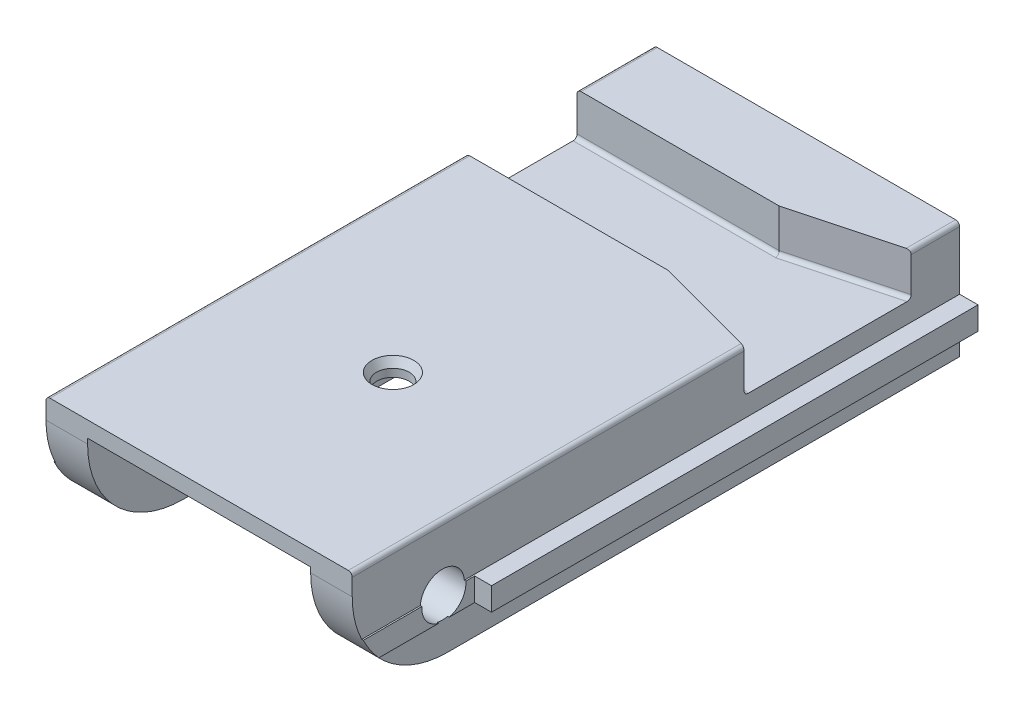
ISO-10303-21;
HEADER;
FILE_DESCRIPTION(('STEP AP214'),'2;1');
FILE_NAME('part.step','',(''),(''),'','','');
FILE_SCHEMA(('AUTOMOTIVE_DESIGN { 1 0 10303 214 1 1 1 1 }'));
ENDSEC;
DATA;
#1=APPLICATION_CONTEXT('core data for automotive mechanical design processes');
#2=APPLICATION_PROTOCOL_DEFINITION('international standard','automotive_design',2000,#1);
#3=PRODUCT_CONTEXT('',#1,'mechanical');
#4=PRODUCT('Part','Part','',(#3));
#5=PRODUCT_RELATED_PRODUCT_CATEGORY('part','',(#4));
#6=PRODUCT_DEFINITION_FORMATION('','',#4);
#7=PRODUCT_DEFINITION_CONTEXT('part definition',#1,'design');
#8=PRODUCT_DEFINITION('design','',#6,#7);
#9=PRODUCT_DEFINITION_SHAPE('','',#8);
#10=(LENGTH_UNIT() NAMED_UNIT(*) SI_UNIT(.MILLI.,.METRE.));
#11=(NAMED_UNIT(*) PLANE_ANGLE_UNIT() SI_UNIT($,.RADIAN.));
#12=(NAMED_UNIT(*) SI_UNIT($,.STERADIAN.) SOLID_ANGLE_UNIT());
#13=UNCERTAINTY_MEASURE_WITH_UNIT(LENGTH_MEASURE(1.E-05),#10,'distance_accuracy_value','');
#14=(GEOMETRIC_REPRESENTATION_CONTEXT(3) GLOBAL_UNCERTAINTY_ASSIGNED_CONTEXT((#13)) GLOBAL_UNIT_ASSIGNED_CONTEXT((#10,
#11,#12)) REPRESENTATION_CONTEXT('',''));
#15=CARTESIAN_POINT('',(0.,0.,0.));
#16=DIRECTION('',(0.,0.,1.));
#17=DIRECTION('',(1.,0.,0.));
#18=AXIS2_PLACEMENT_3D('',#15,#16,#17);
#19=CARTESIAN_POINT('',(11.0998,-34.417,37.740771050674));
#20=DIRECTION('',(-1.,0.,0.));
#21=DIRECTION('',(0.,0.,1.));
#22=AXIS2_PLACEMENT_3D('',#19,#20,#21);
#23=PLANE('',#22);
#24=CARTESIAN_POINT('',(11.0998,-13.335,30.3915083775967));
#25=DIRECTION('',(-1.,0.,0.));
#26=DIRECTION('',(0.,0.,1.));
#27=AXIS2_PLACEMENT_3D('',#24,#25,#26);
#28=CIRCLE('',#27,22.225);
#29=CARTESIAN_POINT('',(11.0998,0.,48.1715083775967));
#30=VERTEX_POINT('',#29);
#31=CARTESIAN_POINT('',(11.0998,8.44453789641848,25.9640538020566));
#32=VERTEX_POINT('',#31);
#33=EDGE_CURVE('E379',#30,#32,#28,.T.);
#34=ORIENTED_EDGE('',*,*,#33,.F.);
#35=DIRECTION('',(0.,0.,-1.));
#36=VECTOR('',#35,1.);
#37=CARTESIAN_POINT('',(11.0998,0.,0.));
#38=LINE('',#37,#36);
#39=CARTESIAN_POINT('',(11.0998,0.,50.927));
#40=VERTEX_POINT('',#39);
#41=EDGE_CURVE('E573',#40,#30,#38,.T.);
#42=ORIENTED_EDGE('',*,*,#41,.F.);
#43=CARTESIAN_POINT('',(11.0998,9.525,50.927));
#44=DIRECTION('',(-1.,0.,0.));
#45=DIRECTION('',(0.,0.,1.));
#46=AXIS2_PLACEMENT_3D('',#43,#44,#45);
#47=CIRCLE('',#46,9.525);
#48=CARTESIAN_POINT('',(11.0998,9.525,60.452));
#49=VERTEX_POINT('',#48);
#50=EDGE_CURVE('E467',#49,#40,#47,.F.);
#51=ORIENTED_EDGE('',*,*,#50,.F.);
#52=DIRECTION('',(0.,-1.,0.));
#53=VECTOR('',#52,1.);
#54=CARTESIAN_POINT('',(11.0998,0.,60.452));
#55=LINE('',#54,#53);
#56=CARTESIAN_POINT('',(11.0998,10.033,60.452));
#57=VERTEX_POINT('',#56);
#58=EDGE_CURVE('E569',#57,#49,#55,.T.);
#59=ORIENTED_EDGE('',*,*,#58,.F.);
#60=DIRECTION('',(0.,0.,1.));
#61=VECTOR('',#60,1.);
#62=CARTESIAN_POINT('',(11.0998,10.033,60.452));
#63=LINE('',#62,#61);
#64=CARTESIAN_POINT('',(11.0998,10.033,37.740771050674));
#65=VERTEX_POINT('',#64);
#66=EDGE_CURVE('E566',#65,#57,#63,.T.);
#67=ORIENTED_EDGE('',*,*,#66,.F.);
#68=CARTESIAN_POINT('',(11.0998,-34.417,37.740771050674));
#69=DIRECTION('',(1.,0.,0.));
#70=DIRECTION('',(0.,0.,1.));
#71=AXIS2_PLACEMENT_3D('',#68,#69,#70);
#72=CIRCLE('',#71,44.45);
#73=EDGE_CURVE('E546',#32,#65,#72,.T.);
#74=ORIENTED_EDGE('',*,*,#73,.F.);
#75=EDGE_LOOP('',(#34,#42,#51,#59,#67,#74));
#76=FACE_BOUND('',#75,.T.);
#77=CARTESIAN_POINT('',(11.0998,5.23239999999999,51.4858));
#78=DIRECTION('',(-1.,0.,0.));
#79=DIRECTION('',(0.,0.,1.));
#80=AXIS2_PLACEMENT_3D('',#77,#78,#79);
#81=CIRCLE('',#80,2.1971);
#82=CARTESIAN_POINT('',(11.0998,5.23239999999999,53.6829));
#83=VERTEX_POINT('',#82);
#84=EDGE_CURVE('E427',#83,#83,#81,.T.);
#85=ORIENTED_EDGE('',*,*,#84,.F.);
#86=EDGE_LOOP('',(#85));
#87=FACE_BOUND('',#86,.T.);
#88=ADVANCED_FACE('F37',(#76,#87),#23,.T.);
#89=CARTESIAN_POINT('',(17.0688,3.09879999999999,60.452));
#90=DIRECTION('',(0.,1.,0.));
#91=DIRECTION('',(-1.,0.,0.));
#92=AXIS2_PLACEMENT_3D('',#89,#90,#91);
#93=PLANE('',#92);
#94=DIRECTION('',(0.,0.,-1.));
#95=VECTOR('',#94,1.);
#96=CARTESIAN_POINT('',(15.24,3.09879999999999,60.452));
#97=LINE('',#96,#95);
#98=CARTESIAN_POINT('',(15.24,3.0988,57.9576172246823));
#99=VERTEX_POINT('',#98);
#100=CARTESIAN_POINT('',(15.24,3.0988,52.0102038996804));
#101=VERTEX_POINT('',#100);
#102=EDGE_CURVE('E684',#99,#101,#97,.T.);
#103=ORIENTED_EDGE('',*,*,#102,.T.);
#104=DIRECTION('',(1.,0.,0.));
#105=VECTOR('',#104,1.);
#106=CARTESIAN_POINT('',(-17.0688,3.0988,52.0102038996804));
#107=LINE('',#106,#105);
#108=CARTESIAN_POINT('',(15.3924,3.09879999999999,52.0102038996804));
#109=VERTEX_POINT('',#108);
#110=EDGE_CURVE('E390',#101,#109,#107,.T.);
#111=ORIENTED_EDGE('',*,*,#110,.T.);
#112=DIRECTION('',(0.,0.,1.));
#113=VECTOR('',#112,1.);
#114=CARTESIAN_POINT('',(15.3924,3.09879999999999,60.452));
#115=LINE('',#114,#113);
#116=CARTESIAN_POINT('',(15.3924,3.0988,57.9576172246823));
#117=VERTEX_POINT('',#116);
#118=EDGE_CURVE('E481',#109,#117,#115,.T.);
#119=ORIENTED_EDGE('',*,*,#118,.T.);
#120=DIRECTION('',(1.,0.,0.));
#121=VECTOR('',#120,1.);
#122=CARTESIAN_POINT('',(-17.0688,3.0988,57.9576172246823));
#123=LINE('',#122,#121);
#124=EDGE_CURVE('E443',#117,#99,#123,.F.);
#125=ORIENTED_EDGE('',*,*,#124,.T.);
#126=EDGE_LOOP('',(#103,#111,#119,#125));
#127=FACE_BOUND('',#126,.T.);
#128=ADVANCED_FACE('F847',(#127),#93,.F.);
#129=CARTESIAN_POINT('',(17.0688,5.38479999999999,60.452));
#130=DIRECTION('',(0.,-1.,0.));
#131=DIRECTION('',(0.,0.,-1.));
#132=AXIS2_PLACEMENT_3D('',#129,#130,#131);
#133=PLANE('',#132);
#134=DIRECTION('',(0.,0.,-1.));
#135=VECTOR('',#134,1.);
#136=CARTESIAN_POINT('',(15.24,5.38479999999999,60.452));
#137=LINE('',#136,#135);
#138=CARTESIAN_POINT('',(15.24,5.38479999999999,49.2939919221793));
#139=VERTEX_POINT('',#138);
#140=CARTESIAN_POINT('',(15.24,5.38479999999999,0.));
#141=VERTEX_POINT('',#140);
#142=EDGE_CURVE('E675',#139,#141,#137,.T.);
#143=ORIENTED_EDGE('',*,*,#142,.F.);
#144=DIRECTION('',(1.,0.,0.));
#145=VECTOR('',#144,1.);
#146=CARTESIAN_POINT('',(-17.0688,5.38479999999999,49.2939919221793));
#147=LINE('',#146,#145);
#148=CARTESIAN_POINT('',(15.3924,5.38479999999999,49.2939919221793));
#149=VERTEX_POINT('',#148);
#150=EDGE_CURVE('E399',#139,#149,#147,.T.);
#151=ORIENTED_EDGE('',*,*,#150,.T.);
#152=DIRECTION('',(0.,0.,-1.));
#153=VECTOR('',#152,1.);
#154=CARTESIAN_POINT('',(15.3924,5.38479999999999,60.452));
#155=LINE('',#154,#153);
#156=CARTESIAN_POINT('',(15.3924,5.38479999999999,48.41875));
#157=VERTEX_POINT('',#156);
#158=EDGE_CURVE('E476',#149,#157,#155,.T.);
#159=ORIENTED_EDGE('',*,*,#158,.T.);
#160=DIRECTION('',(1.,0.,0.));
#161=VECTOR('',#160,1.);
#162=CARTESIAN_POINT('',(17.0688,5.38479999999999,48.41875));
#163=LINE('',#162,#161);
#164=CARTESIAN_POINT('',(17.0688,5.38479999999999,48.41875));
#165=VERTEX_POINT('',#164);
#166=EDGE_CURVE('E692',#157,#165,#163,.T.);
#167=ORIENTED_EDGE('',*,*,#166,.T.);
#168=DIRECTION('',(0.,0.,-1.));
#169=VECTOR('',#168,1.);
#170=CARTESIAN_POINT('',(17.0688,5.38479999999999,60.452));
#171=LINE('',#170,#169);
#172=CARTESIAN_POINT('',(17.0688,5.38479999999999,0.));
#173=VERTEX_POINT('',#172);
#174=EDGE_CURVE('E679',#165,#173,#171,.T.);
#175=ORIENTED_EDGE('',*,*,#174,.T.);
#176=DIRECTION('',(-1.,0.,0.));
#177=VECTOR('',#176,1.);
#178=CARTESIAN_POINT('',(17.0688,5.38479999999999,0.));
#179=LINE('',#178,#177);
#180=EDGE_CURVE('E611',#173,#141,#179,.T.);
#181=ORIENTED_EDGE('',*,*,#180,.T.);
#182=EDGE_LOOP('',(#143,#151,#159,#167,#175,#181));
#183=FACE_BOUND('',#182,.T.);
#184=ADVANCED_FACE('F839',(#183),#133,.F.);
#185=CARTESIAN_POINT('',(-15.24,5.38479999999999,60.452));
#186=DIRECTION('',(0.,-1.,0.));
#187=DIRECTION('',(0.,0.,-1.));
#188=AXIS2_PLACEMENT_3D('',#185,#186,#187);
#189=PLANE('',#188);
#190=DIRECTION('',(0.,0.,1.));
#191=VECTOR('',#190,1.);
#192=CARTESIAN_POINT('',(-15.3924,5.38479999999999,60.452));
#193=LINE('',#192,#191);
#194=CARTESIAN_POINT('',(-15.3924,5.38479999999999,48.41875));
#195=VERTEX_POINT('',#194);
#196=CARTESIAN_POINT('',(-15.3924,5.38479999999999,49.2939919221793));
#197=VERTEX_POINT('',#196);
#198=EDGE_CURVE('E499',#195,#197,#193,.T.);
#199=ORIENTED_EDGE('',*,*,#198,.T.);
#200=DIRECTION('',(1.,0.,0.));
#201=VECTOR('',#200,1.);
#202=CARTESIAN_POINT('',(-17.0688,5.38479999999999,49.2939919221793));
#203=LINE('',#202,#201);
#204=CARTESIAN_POINT('',(-15.24,5.38479999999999,49.2939919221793));
#205=VERTEX_POINT('',#204);
#206=EDGE_CURVE('E412',#197,#205,#203,.T.);
#207=ORIENTED_EDGE('',*,*,#206,.T.);
#208=DIRECTION('',(0.,0.,-1.));
#209=VECTOR('',#208,1.);
#210=CARTESIAN_POINT('',(-15.24,5.38479999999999,60.452));
#211=LINE('',#210,#209);
#212=CARTESIAN_POINT('',(-15.24,5.38479999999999,0.));
#213=VERTEX_POINT('',#212);
#214=EDGE_CURVE('E655',#205,#213,#211,.T.);
#215=ORIENTED_EDGE('',*,*,#214,.T.);
#216=DIRECTION('',(-1.,0.,0.));
#217=VECTOR('',#216,1.);
#218=CARTESIAN_POINT('',(-15.24,5.38479999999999,0.));
#219=LINE('',#218,#217);
#220=CARTESIAN_POINT('',(-17.0688,5.38479999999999,0.));
#221=VERTEX_POINT('',#220);
#222=EDGE_CURVE('E629',#213,#221,#219,.T.);
#223=ORIENTED_EDGE('',*,*,#222,.T.);
#224=DIRECTION('',(0.,0.,-1.));
#225=VECTOR('',#224,1.);
#226=CARTESIAN_POINT('',(-17.0688,5.38479999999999,60.452));
#227=LINE('',#226,#225);
#228=CARTESIAN_POINT('',(-17.0688,5.38479999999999,48.41875));
#229=VERTEX_POINT('',#228);
#230=EDGE_CURVE('E653',#229,#221,#227,.T.);
#231=ORIENTED_EDGE('',*,*,#230,.F.);
#232=DIRECTION('',(1.,0.,0.));
#233=VECTOR('',#232,1.);
#234=CARTESIAN_POINT('',(-15.24,5.38479999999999,48.41875));
#235=LINE('',#234,#233);
#236=EDGE_CURVE('E502',#229,#195,#235,.T.);
#237=ORIENTED_EDGE('',*,*,#236,.T.);
#238=EDGE_LOOP('',(#199,#207,#215,#223,#231,#237));
#239=FACE_BOUND('',#238,.T.);
#240=ADVANCED_FACE('F811',(#239),#189,.F.);
#241=CARTESIAN_POINT('',(-15.24,3.09879999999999,60.452));
#242=DIRECTION('',(0.,1.,0.));
#243=DIRECTION('',(-1.,0.,0.));
#244=AXIS2_PLACEMENT_3D('',#241,#242,#243);
#245=PLANE('',#244);
#246=DIRECTION('',(0.,0.,-1.));
#247=VECTOR('',#246,1.);
#248=CARTESIAN_POINT('',(-15.3924,3.09879999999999,60.452));
#249=LINE('',#248,#247);
#250=CARTESIAN_POINT('',(-15.3924,3.0988,57.9576172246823));
#251=VERTEX_POINT('',#250);
#252=CARTESIAN_POINT('',(-15.3924,3.09879999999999,52.0102038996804));
#253=VERTEX_POINT('',#252);
#254=EDGE_CURVE('E495',#251,#253,#249,.T.);
#255=ORIENTED_EDGE('',*,*,#254,.T.);
#256=DIRECTION('',(1.,0.,0.));
#257=VECTOR('',#256,1.);
#258=CARTESIAN_POINT('',(-17.0688,3.09879999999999,52.0102038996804));
#259=LINE('',#258,#257);
#260=CARTESIAN_POINT('',(-15.24,3.09879999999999,52.0102038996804));
#261=VERTEX_POINT('',#260);
#262=EDGE_CURVE('E421',#253,#261,#259,.T.);
#263=ORIENTED_EDGE('',*,*,#262,.T.);
#264=DIRECTION('',(0.,0.,-1.));
#265=VECTOR('',#264,1.);
#266=CARTESIAN_POINT('',(-15.24,3.09879999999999,60.452));
#267=LINE('',#266,#265);
#268=CARTESIAN_POINT('',(-15.24,3.0988,57.9576172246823));
#269=VERTEX_POINT('',#268);
#270=EDGE_CURVE('E648',#269,#261,#267,.T.);
#271=ORIENTED_EDGE('',*,*,#270,.F.);
#272=DIRECTION('',(1.,0.,0.));
#273=VECTOR('',#272,1.);
#274=CARTESIAN_POINT('',(-17.0688,3.0988,57.9576172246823));
#275=LINE('',#274,#273);
#276=EDGE_CURVE('E455',#269,#251,#275,.F.);
#277=ORIENTED_EDGE('',*,*,#276,.T.);
#278=EDGE_LOOP('',(#255,#263,#271,#277));
#279=FACE_BOUND('',#278,.T.);
#280=ADVANCED_FACE('F802',(#279),#245,.F.);
#281=CARTESIAN_POINT('',(-15.3924,0.,48.41875));
#282=DIRECTION('',(1.,0.,0.));
#283=DIRECTION('',(0.,0.,-1.));
#284=AXIS2_PLACEMENT_3D('',#281,#282,#283);
#285=PLANE('',#284);
#286=CARTESIAN_POINT('',(-15.3924,5.38479999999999,53.6776080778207));
#287=VERTEX_POINT('',#286);
#288=CARTESIAN_POINT('',(-15.3924,5.38479999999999,59.5051331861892));
#289=VERTEX_POINT('',#288);
#290=EDGE_CURVE('E498',#287,#289,#193,.T.);
#291=ORIENTED_EDGE('',*,*,#290,.F.);
#292=CARTESIAN_POINT('',(-15.3924,5.23239999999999,51.4858));
#293=DIRECTION('',(1.,0.,0.));
#294=DIRECTION('',(0.,0.,-1.));
#295=AXIS2_PLACEMENT_3D('',#292,#293,#294);
#296=CIRCLE('',#295,2.1971);
#297=EDGE_CURVE('E409',#287,#253,#296,.T.);
#298=ORIENTED_EDGE('',*,*,#297,.T.);
#299=ORIENTED_EDGE('',*,*,#254,.F.);
#300=CARTESIAN_POINT('',(-15.3924,9.525,50.927));
#301=DIRECTION('',(1.,0.,0.));
#302=DIRECTION('',(0.,0.,-1.));
#303=AXIS2_PLACEMENT_3D('',#300,#301,#302);
#304=CIRCLE('',#303,9.525);
#305=EDGE_CURVE('E452',#251,#289,#304,.F.);
#306=ORIENTED_EDGE('',*,*,#305,.T.);
#307=EDGE_LOOP('',(#291,#298,#299,#306));
#308=FACE_BOUND('',#307,.T.);
#309=ADVANCED_FACE('F996',(#308),#285,.F.);
#310=CARTESIAN_POINT('',(15.3924,0.,48.41875));
#311=DIRECTION('',(-1.,0.,0.));
#312=DIRECTION('',(0.,0.,1.));
#313=AXIS2_PLACEMENT_3D('',#310,#311,#312);
#314=PLANE('',#313);
#315=ORIENTED_EDGE('',*,*,#158,.F.);
#316=CARTESIAN_POINT('',(15.3924,5.23239999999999,51.4858));
#317=DIRECTION('',(-1.,0.,0.));
#318=DIRECTION('',(0.,0.,1.));
#319=AXIS2_PLACEMENT_3D('',#316,#317,#318);
#320=CIRCLE('',#319,2.1971);
#321=CARTESIAN_POINT('',(15.3924,3.0988,50.9613961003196));
#322=VERTEX_POINT('',#321);
#323=EDGE_CURVE('E701',#149,#322,#320,.T.);
#324=ORIENTED_EDGE('',*,*,#323,.T.);
#325=CARTESIAN_POINT('',(15.3924,3.09879999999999,48.41875));
#326=VERTEX_POINT('',#325);
#327=EDGE_CURVE('E482',#326,#322,#115,.T.);
#328=ORIENTED_EDGE('',*,*,#327,.F.);
#329=DIRECTION('',(0.,1.,0.));
#330=VECTOR('',#329,1.);
#331=CARTESIAN_POINT('',(15.3924,0.,48.41875));
#332=LINE('',#331,#330);
#333=EDGE_CURVE('E473',#326,#157,#332,.T.);
#334=ORIENTED_EDGE('',*,*,#333,.T.);
#335=EDGE_LOOP('',(#315,#324,#328,#334));
#336=FACE_BOUND('',#335,.T.);
#337=ADVANCED_FACE('F1194',(#336),#314,.F.);
#338=CARTESIAN_POINT('',(14.843125,11.210925,60.452));
#339=DIRECTION('',(0.,0.,-1.));
#340=DIRECTION('',(-1.,0.,0.));
#341=AXIS2_PLACEMENT_3D('',#338,#339,#340);
#342=CYLINDRICAL_SURFACE('',#341,0.396875);
#343=DIRECTION('',(0.,0.,-1.));
#344=VECTOR('',#343,1.);
#345=CARTESIAN_POINT('',(14.843125,11.6078,60.452));
#346=LINE('',#345,#344);
#347=CARTESIAN_POINT('',(14.843125,11.6078,4.9228173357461));
#348=VERTEX_POINT('',#347);
#349=CARTESIAN_POINT('',(14.843125,11.6078,0.));
#350=VERTEX_POINT('',#349);
#351=EDGE_CURVE('E667',#348,#350,#346,.T.);
#352=ORIENTED_EDGE('',*,*,#351,.F.);
#353=CARTESIAN_POINT('',(14.843125,11.210925,4.92281733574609));
#354=DIRECTION('',(-0.258819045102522,0.,-0.965925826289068));
#355=DIRECTION('',(0.965925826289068,0.,-0.258819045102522));
#356=AXIS2_PLACEMENT_3D('',#353,#354,#355);
#357=ELLIPSE('',#356,0.410875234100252,0.396875);
#358=CARTESIAN_POINT('',(15.24,11.210925,4.81647499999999));
#359=VERTEX_POINT('',#358);
#360=EDGE_CURVE('E543',#348,#359,#357,.T.);
#361=ORIENTED_EDGE('',*,*,#360,.T.);
#362=DIRECTION('',(0.,0.,-1.));
#363=VECTOR('',#362,1.);
#364=CARTESIAN_POINT('',(15.24,11.210925,60.452));
#365=LINE('',#364,#363);
#366=CARTESIAN_POINT('',(15.24,11.210925,0.));
#367=VERTEX_POINT('',#366);
#368=EDGE_CURVE('E671',#359,#367,#365,.T.);
#369=ORIENTED_EDGE('',*,*,#368,.T.);
#370=CARTESIAN_POINT('',(14.843125,11.210925,0.));
#371=DIRECTION('',(0.,0.,1.));
#372=DIRECTION('',(1.,0.,0.));
#373=AXIS2_PLACEMENT_3D('',#370,#371,#372);
#374=CIRCLE('',#373,0.396875);
#375=EDGE_CURVE('E617',#367,#350,#374,.T.);
#376=ORIENTED_EDGE('',*,*,#375,.T.);
#377=EDGE_LOOP('',(#352,#361,#369,#376));
#378=FACE_BOUND('',#377,.T.);
#379=ADVANCED_FACE('F830',(#378),#342,.T.);
#380=CARTESIAN_POINT('',(14.843125,11.6078,60.452));
#381=DIRECTION('',(0.,-1.,0.));
#382=DIRECTION('',(0.,0.,-1.));
#383=AXIS2_PLACEMENT_3D('',#380,#381,#382);
#384=PLANE('',#383);
#385=DIRECTION('',(0.,0.,-1.));
#386=VECTOR('',#385,1.);
#387=CARTESIAN_POINT('',(-14.843125,11.6078,60.452));
#388=LINE('',#387,#386);
#389=CARTESIAN_POINT('',(-14.843125,11.6078,7.5946));
#390=VERTEX_POINT('',#389);
#391=CARTESIAN_POINT('',(-14.843125,11.6078,0.));
#392=VERTEX_POINT('',#391);
#393=EDGE_CURVE('E663',#390,#392,#388,.T.);
#394=ORIENTED_EDGE('',*,*,#393,.F.);
#395=DIRECTION('',(-1.,0.,0.));
#396=VECTOR('',#395,1.);
#397=CARTESIAN_POINT('',(-15.24,11.6078,7.5946));
#398=LINE('',#397,#396);
#399=CARTESIAN_POINT('',(4.87189635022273,11.6078,7.5946));
#400=VERTEX_POINT('',#399);
#401=EDGE_CURVE('E522',#400,#390,#398,.T.);
#402=ORIENTED_EDGE('',*,*,#401,.F.);
#403=DIRECTION('',(-0.965925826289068,0.,0.258819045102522));
#404=VECTOR('',#403,1.);
#405=CARTESIAN_POINT('',(4.87189635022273,11.6078,7.5946));
#406=LINE('',#405,#404);
#407=EDGE_CURVE('E519',#348,#400,#406,.T.);
#408=ORIENTED_EDGE('',*,*,#407,.F.);
#409=ORIENTED_EDGE('',*,*,#351,.T.);
#410=DIRECTION('',(-1.,0.,0.));
#411=VECTOR('',#410,1.);
#412=CARTESIAN_POINT('',(14.843125,11.6078,0.));
#413=LINE('',#412,#411);
#414=EDGE_CURVE('E620',#350,#392,#413,.T.);
#415=ORIENTED_EDGE('',*,*,#414,.T.);
#416=EDGE_LOOP('',(#394,#402,#408,#409,#415));
#417=FACE_BOUND('',#416,.T.);
#418=ADVANCED_FACE('F825',(#417),#384,.F.);
#419=CARTESIAN_POINT('',(-14.843125,11.210925,60.452));
#420=DIRECTION('',(0.,0.,-1.));
#421=DIRECTION('',(-1.,0.,0.));
#422=AXIS2_PLACEMENT_3D('',#419,#420,#421);
#423=CYLINDRICAL_SURFACE('',#422,0.396875);
#424=CARTESIAN_POINT('',(-14.843125,11.6078,60.452));
#425=VERTEX_POINT('',#424);
#426=CARTESIAN_POINT('',(-14.843125,11.6078,18.669));
#427=VERTEX_POINT('',#426);
#428=EDGE_CURVE('E664',#425,#427,#388,.T.);
#429=ORIENTED_EDGE('',*,*,#428,.T.);
#430=CARTESIAN_POINT('',(-14.843125,11.210925,18.669));
#431=DIRECTION('',(0.,0.,1.));
#432=DIRECTION('',(1.,0.,0.));
#433=AXIS2_PLACEMENT_3D('',#430,#431,#432);
#434=CIRCLE('',#433,0.396875);
#435=CARTESIAN_POINT('',(-15.24,11.210925,18.669));
#436=VERTEX_POINT('',#435);
#437=EDGE_CURVE('E537',#427,#436,#434,.T.);
#438=ORIENTED_EDGE('',*,*,#437,.T.);
#439=DIRECTION('',(0.,0.,-1.));
#440=VECTOR('',#439,1.);
#441=CARTESIAN_POINT('',(-15.24,11.210925,60.452));
#442=LINE('',#441,#440);
#443=CARTESIAN_POINT('',(-15.24,11.210925,60.452));
#444=VERTEX_POINT('',#443);
#445=EDGE_CURVE('E660',#444,#436,#442,.T.);
#446=ORIENTED_EDGE('',*,*,#445,.F.);
#447=CARTESIAN_POINT('',(-14.843125,11.210925,60.452));
#448=DIRECTION('',(0.,0.,1.));
#449=DIRECTION('',(1.,0.,0.));
#450=AXIS2_PLACEMENT_3D('',#447,#448,#449);
#451=CIRCLE('',#450,0.396875);
#452=EDGE_CURVE('E597',#425,#444,#451,.T.);
#453=ORIENTED_EDGE('',*,*,#452,.F.);
#454=EDGE_LOOP('',(#429,#438,#446,#453));
#455=FACE_BOUND('',#454,.T.);
#456=ADVANCED_FACE('F820',(#455),#423,.T.);
#457=CARTESIAN_POINT('',(15.24,0.,60.452));
#458=DIRECTION('',(0.,1.,0.));
#459=DIRECTION('',(0.,0.,1.));
#460=AXIS2_PLACEMENT_3D('',#457,#458,#459);
#461=PLANE('',#460);
#462=ORIENTED_EDGE('',*,*,#41,.T.);
#463=DIRECTION('',(-1.,0.,0.));
#464=VECTOR('',#463,1.);
#465=CARTESIAN_POINT('',(14.2748,0.,48.1715083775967));
#466=LINE('',#465,#464);
#467=CARTESIAN_POINT('',(14.2748,0.,48.1715083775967));
#468=VERTEX_POINT('',#467);
#469=EDGE_CURVE('E384',#468,#30,#466,.T.);
#470=ORIENTED_EDGE('',*,*,#469,.F.);
#471=DIRECTION('',(0.,0.,1.));
#472=VECTOR('',#471,1.);
#473=CARTESIAN_POINT('',(14.2748,0.,6.82625));
#474=LINE('',#473,#472);
#475=CARTESIAN_POINT('',(14.2748,0.,6.82625));
#476=VERTEX_POINT('',#475);
#477=EDGE_CURVE('E366',#476,#468,#474,.T.);
#478=ORIENTED_EDGE('',*,*,#477,.F.);
#479=DIRECTION('',(-1.,0.,0.));
#480=VECTOR('',#479,1.);
#481=CARTESIAN_POINT('',(14.2748,0.,6.82625));
#482=LINE('',#481,#480);
#483=CARTESIAN_POINT('',(11.0998,0.,6.82625));
#484=VERTEX_POINT('',#483);
#485=EDGE_CURVE('E365',#476,#484,#482,.T.);
#486=ORIENTED_EDGE('',*,*,#485,.T.);
#487=CARTESIAN_POINT('',(11.0998,0.,0.));
#488=VERTEX_POINT('',#487);
#489=EDGE_CURVE('E572',#484,#488,#38,.T.);
#490=ORIENTED_EDGE('',*,*,#489,.T.);
#491=DIRECTION('',(1.,0.,0.));
#492=VECTOR('',#491,1.);
#493=CARTESIAN_POINT('',(15.24,0.,0.));
#494=LINE('',#493,#492);
#495=CARTESIAN_POINT('',(15.24,0.,0.));
#496=VERTEX_POINT('',#495);
#497=EDGE_CURVE('E641',#488,#496,#494,.T.);
#498=ORIENTED_EDGE('',*,*,#497,.T.);
#499=DIRECTION('',(0.,0.,-1.));
#500=VECTOR('',#499,1.);
#501=CARTESIAN_POINT('',(15.24,0.,60.452));
#502=LINE('',#501,#500);
#503=CARTESIAN_POINT('',(15.24,0.,50.927));
#504=VERTEX_POINT('',#503);
#505=EDGE_CURVE('E602',#504,#496,#502,.T.);
#506=ORIENTED_EDGE('',*,*,#505,.F.);
#507=DIRECTION('',(1.,0.,0.));
#508=VECTOR('',#507,1.);
#509=CARTESIAN_POINT('',(-17.0688,0.,50.927));
#510=LINE('',#509,#508);
#511=EDGE_CURVE('E434',#40,#504,#510,.T.);
#512=ORIENTED_EDGE('',*,*,#511,.F.);
#513=EDGE_LOOP('',(#462,#470,#478,#486,#490,#498,#506,#512));
#514=FACE_BOUND('',#513,.T.);
#515=ADVANCED_FACE('F793',(#514),#461,.F.);
#516=CARTESIAN_POINT('',(15.24,0.,60.452));
#517=DIRECTION('',(-1.,0.,0.));
#518=DIRECTION('',(0.,0.,1.));
#519=AXIS2_PLACEMENT_3D('',#516,#517,#518);
#520=PLANE('',#519);
#521=CARTESIAN_POINT('',(15.24,3.09879999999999,50.9613961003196));
#522=VERTEX_POINT('',#521);
#523=CARTESIAN_POINT('',(15.24,3.09879999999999,0.));
#524=VERTEX_POINT('',#523);
#525=EDGE_CURVE('E683',#522,#524,#97,.T.);
#526=ORIENTED_EDGE('',*,*,#525,.F.);
#527=CARTESIAN_POINT('',(15.24,5.23239999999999,51.4858));
#528=DIRECTION('',(-1.,0.,0.));
#529=DIRECTION('',(0.,0.,1.));
#530=AXIS2_PLACEMENT_3D('',#527,#528,#529);
#531=CIRCLE('',#530,2.1971);
#532=EDGE_CURVE('E393',#522,#101,#531,.T.);
#533=ORIENTED_EDGE('',*,*,#532,.T.);
#534=ORIENTED_EDGE('',*,*,#102,.F.);
#535=CARTESIAN_POINT('',(15.24,9.525,50.927));
#536=DIRECTION('',(-1.,0.,0.));
#537=DIRECTION('',(0.,0.,1.));
#538=AXIS2_PLACEMENT_3D('',#535,#536,#537);
#539=CIRCLE('',#538,9.525);
#540=EDGE_CURVE('E446',#99,#504,#539,.F.);
#541=ORIENTED_EDGE('',*,*,#540,.T.);
#542=ORIENTED_EDGE('',*,*,#505,.T.);
#543=DIRECTION('',(0.,1.,0.));
#544=VECTOR('',#543,1.);
#545=CARTESIAN_POINT('',(15.24,0.,0.));
#546=LINE('',#545,#544);
#547=EDGE_CURVE('E581',#496,#524,#546,.T.);
#548=ORIENTED_EDGE('',*,*,#547,.T.);
#549=EDGE_LOOP('',(#526,#533,#534,#541,#542,#548));
#550=FACE_BOUND('',#549,.T.);
#551=ADVANCED_FACE('F845',(#550),#520,.F.);
#552=ORIENTED_EDGE('',*,*,#327,.T.);
#553=DIRECTION('',(1.,0.,0.));
#554=VECTOR('',#553,1.);
#555=CARTESIAN_POINT('',(-17.0688,3.0988,50.9613961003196));
#556=LINE('',#555,#554);
#557=EDGE_CURVE('E402',#322,#522,#556,.F.);
#558=ORIENTED_EDGE('',*,*,#557,.T.);
#559=ORIENTED_EDGE('',*,*,#525,.T.);
#560=DIRECTION('',(1.,0.,0.));
#561=VECTOR('',#560,1.);
#562=CARTESIAN_POINT('',(17.0688,3.09879999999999,0.));
#563=LINE('',#562,#561);
#564=CARTESIAN_POINT('',(17.0688,3.09879999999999,0.));
#565=VERTEX_POINT('',#564);
#566=EDGE_CURVE('E605',#524,#565,#563,.T.);
#567=ORIENTED_EDGE('',*,*,#566,.T.);
#568=DIRECTION('',(0.,0.,-1.));
#569=VECTOR('',#568,1.);
#570=CARTESIAN_POINT('',(17.0688,3.09879999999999,60.452));
#571=LINE('',#570,#569);
#572=CARTESIAN_POINT('',(17.0688,3.09879999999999,48.41875));
#573=VERTEX_POINT('',#572);
#574=EDGE_CURVE('E681',#573,#565,#571,.T.);
#575=ORIENTED_EDGE('',*,*,#574,.F.);
#576=DIRECTION('',(-1.,0.,0.));
#577=VECTOR('',#576,1.);
#578=CARTESIAN_POINT('',(17.0688,3.09879999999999,48.41875));
#579=LINE('',#578,#577);
#580=EDGE_CURVE('E485',#573,#326,#579,.T.);
#581=ORIENTED_EDGE('',*,*,#580,.T.);
#582=EDGE_LOOP('',(#552,#558,#559,#567,#575,#581));
#583=FACE_BOUND('',#582,.T.);
#584=ADVANCED_FACE('F842',(#583),#93,.F.);
#585=CARTESIAN_POINT('',(17.0688,3.09879999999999,60.452));
#586=DIRECTION('',(-1.,0.,0.));
#587=DIRECTION('',(0.,0.,1.));
#588=AXIS2_PLACEMENT_3D('',#585,#586,#587);
#589=PLANE('',#588);
#590=ORIENTED_EDGE('',*,*,#174,.F.);
#591=DIRECTION('',(0.,1.,0.));
#592=VECTOR('',#591,1.);
#593=CARTESIAN_POINT('',(17.0688,0.,48.41875));
#594=LINE('',#593,#592);
#595=EDGE_CURVE('E472',#573,#165,#594,.T.);
#596=ORIENTED_EDGE('',*,*,#595,.F.);
#597=ORIENTED_EDGE('',*,*,#574,.T.);
#598=DIRECTION('',(0.,1.,0.));
#599=VECTOR('',#598,1.);
#600=CARTESIAN_POINT('',(17.0688,3.09879999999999,0.));
#601=LINE('',#600,#599);
#602=EDGE_CURVE('E608',#565,#173,#601,.T.);
#603=ORIENTED_EDGE('',*,*,#602,.T.);
#604=EDGE_LOOP('',(#590,#596,#597,#603));
#605=FACE_BOUND('',#604,.T.);
#606=ADVANCED_FACE('F837',(#605),#589,.F.);
#607=CARTESIAN_POINT('',(15.3924,5.38479999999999,59.5051331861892));
#608=VERTEX_POINT('',#607);
#609=CARTESIAN_POINT('',(15.3924,5.38479999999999,53.6776080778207));
#610=VERTEX_POINT('',#609);
#611=EDGE_CURVE('E478',#608,#610,#155,.T.);
#612=ORIENTED_EDGE('',*,*,#611,.T.);
#613=DIRECTION('',(1.,0.,0.));
#614=VECTOR('',#613,1.);
#615=CARTESIAN_POINT('',(-17.0688,5.38479999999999,53.6776080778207));
#616=LINE('',#615,#614);
#617=CARTESIAN_POINT('',(15.24,5.38479999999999,53.6776080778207));
#618=VERTEX_POINT('',#617);
#619=EDGE_CURVE('E386',#610,#618,#616,.F.);
#620=ORIENTED_EDGE('',*,*,#619,.T.);
#621=CARTESIAN_POINT('',(15.24,5.38479999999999,59.5051331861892));
#622=VERTEX_POINT('',#621);
#623=EDGE_CURVE('E676',#622,#618,#137,.T.);
#624=ORIENTED_EDGE('',*,*,#623,.F.);
#625=DIRECTION('',(1.,0.,0.));
#626=VECTOR('',#625,1.);
#627=CARTESIAN_POINT('',(-17.0688,5.38479999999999,59.5051331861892));
#628=LINE('',#627,#626);
#629=EDGE_CURVE('E440',#622,#608,#628,.T.);
#630=ORIENTED_EDGE('',*,*,#629,.T.);
#631=EDGE_LOOP('',(#612,#620,#624,#630));
#632=FACE_BOUND('',#631,.T.);
#633=ADVANCED_FACE('F833',(#632),#133,.F.);
#634=CARTESIAN_POINT('',(15.24,5.38479999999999,60.452));
#635=DIRECTION('',(-1.,0.,0.));
#636=DIRECTION('',(0.,0.,1.));
#637=AXIS2_PLACEMENT_3D('',#634,#635,#636);
#638=PLANE('',#637);
#639=ORIENTED_EDGE('',*,*,#623,.T.);
#640=CARTESIAN_POINT('',(15.24,5.23239999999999,51.4858));
#641=DIRECTION('',(-1.,0.,0.));
#642=DIRECTION('',(0.,0.,1.));
#643=AXIS2_PLACEMENT_3D('',#640,#641,#642);
#644=CIRCLE('',#643,2.1971);
#645=EDGE_CURVE('E396',#618,#139,#644,.T.);
#646=ORIENTED_EDGE('',*,*,#645,.T.);
#647=ORIENTED_EDGE('',*,*,#142,.T.);
#648=DIRECTION('',(0.,1.,0.));
#649=VECTOR('',#648,1.);
#650=CARTESIAN_POINT('',(15.24,5.38479999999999,0.));
#651=LINE('',#650,#649);
#652=EDGE_CURVE('E614',#141,#367,#651,.T.);
#653=ORIENTED_EDGE('',*,*,#652,.T.);
#654=ORIENTED_EDGE('',*,*,#368,.F.);
#655=DIRECTION('',(0.,1.,0.));
#656=VECTOR('',#655,1.);
#657=CARTESIAN_POINT('',(15.24,-34.7218795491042,4.81647499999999));
#658=LINE('',#657,#656);
#659=CARTESIAN_POINT('',(15.24,7.762875,4.81647499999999));
#660=VERTEX_POINT('',#659);
#661=EDGE_CURVE('E530',#660,#359,#658,.T.);
#662=ORIENTED_EDGE('',*,*,#661,.F.);
#663=CARTESIAN_POINT('',(15.24,7.762875,5.22735023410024));
#664=DIRECTION('',(-1.,0.,0.));
#665=DIRECTION('',(0.,0.,-1.));
#666=AXIS2_PLACEMENT_3D('',#663,#664,#665);
#667=ELLIPSE('',#666,0.410875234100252,0.396875);
#668=CARTESIAN_POINT('',(15.24,7.366,5.22735023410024));
#669=VERTEX_POINT('',#668);
#670=EDGE_CURVE('E894',#660,#669,#667,.T.);
#671=ORIENTED_EDGE('',*,*,#670,.T.);
#672=DIRECTION('',(0.,0.,1.));
#673=VECTOR('',#672,1.);
#674=CARTESIAN_POINT('',(15.24,7.366,4.81647499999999));
#675=LINE('',#674,#673);
#676=CARTESIAN_POINT('',(15.24,7.366,21.0362497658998));
#677=VERTEX_POINT('',#676);
#678=EDGE_CURVE('E506',#669,#677,#675,.T.);
#679=ORIENTED_EDGE('',*,*,#678,.T.);
#680=CARTESIAN_POINT('',(15.24,7.762875,21.0362497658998));
#681=DIRECTION('',(-1.,0.,0.));
#682=DIRECTION('',(0.,0.,-1.));
#683=AXIS2_PLACEMENT_3D('',#680,#681,#682);
#684=ELLIPSE('',#683,0.410875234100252,0.396875);
#685=CARTESIAN_POINT('',(15.24,7.762875,21.447125));
#686=VERTEX_POINT('',#685);
#687=EDGE_CURVE('E898',#677,#686,#684,.T.);
#688=ORIENTED_EDGE('',*,*,#687,.T.);
#689=DIRECTION('',(0.,1.,0.));
#690=VECTOR('',#689,1.);
#691=CARTESIAN_POINT('',(15.24,-34.7218795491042,21.447125));
#692=LINE('',#691,#690);
#693=CARTESIAN_POINT('',(15.24,11.210925,21.447125));
#694=VERTEX_POINT('',#693);
#695=EDGE_CURVE('E532',#686,#694,#692,.T.);
#696=ORIENTED_EDGE('',*,*,#695,.T.);
#697=CARTESIAN_POINT('',(15.24,11.210925,60.452));
#698=VERTEX_POINT('',#697);
#699=EDGE_CURVE('E672',#698,#694,#365,.T.);
#700=ORIENTED_EDGE('',*,*,#699,.F.);
#701=DIRECTION('',(0.,1.,0.));
#702=VECTOR('',#701,1.);
#703=CARTESIAN_POINT('',(15.24,5.38479999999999,60.452));
#704=LINE('',#703,#702);
#705=CARTESIAN_POINT('',(15.24,9.525,60.452));
#706=VERTEX_POINT('',#705);
#707=EDGE_CURVE('E590',#706,#698,#704,.T.);
#708=ORIENTED_EDGE('',*,*,#707,.F.);
#709=CARTESIAN_POINT('',(15.24,9.525,50.927));
#710=DIRECTION('',(-1.,0.,0.));
#711=DIRECTION('',(0.,0.,1.));
#712=AXIS2_PLACEMENT_3D('',#709,#710,#711);
#713=CIRCLE('',#712,9.525);
#714=EDGE_CURVE('E449',#706,#622,#713,.F.);
#715=ORIENTED_EDGE('',*,*,#714,.T.);
#716=EDGE_LOOP('',(#639,#646,#647,#653,#654,#662,#671,#679,#688,#696,#700,#708,#715));
#717=FACE_BOUND('',#716,.T.);
#718=ADVANCED_FACE('F828',(#717),#638,.F.);
#719=ORIENTED_EDGE('',*,*,#699,.T.);
#720=CARTESIAN_POINT('',(14.843125,11.210925,21.3407826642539));
#721=DIRECTION('',(-0.258819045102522,0.,0.965925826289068));
#722=DIRECTION('',(-0.965925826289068,0.,-0.258819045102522));
#723=AXIS2_PLACEMENT_3D('',#720,#721,#722);
#724=ELLIPSE('',#723,0.410875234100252,0.396875);
#725=CARTESIAN_POINT('',(14.843125,11.6078,21.3407826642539));
#726=VERTEX_POINT('',#725);
#727=EDGE_CURVE('E540',#694,#726,#724,.T.);
#728=ORIENTED_EDGE('',*,*,#727,.T.);
#729=CARTESIAN_POINT('',(14.843125,11.6078,60.452));
#730=VERTEX_POINT('',#729);
#731=EDGE_CURVE('E668',#730,#726,#346,.T.);
#732=ORIENTED_EDGE('',*,*,#731,.F.);
#733=CARTESIAN_POINT('',(14.843125,11.210925,60.452));
#734=DIRECTION('',(0.,0.,1.));
#735=DIRECTION('',(1.,0.,0.));
#736=AXIS2_PLACEMENT_3D('',#733,#734,#735);
#737=CIRCLE('',#736,0.396875);
#738=EDGE_CURVE('E592',#698,#730,#737,.T.);
#739=ORIENTED_EDGE('',*,*,#738,.F.);
#740=EDGE_LOOP('',(#719,#728,#732,#739));
#741=FACE_BOUND('',#740,.T.);
#742=ADVANCED_FACE('F823',(#741),#342,.T.);
#743=CARTESIAN_POINT('',(0.,11.6078,41.16705));
#744=DIRECTION('',(0.,-1.,0.));
#745=DIRECTION('',(0.,0.,-1.));
#746=AXIS2_PLACEMENT_3D('',#743,#744,#745);
#747=CIRCLE('',#746,2.08387177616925);
#748=CARTESIAN_POINT('',(0.,11.6078,39.0831782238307));
#749=VERTEX_POINT('',#748);
#750=EDGE_CURVE('E705',#749,#749,#747,.T.);
#751=ORIENTED_EDGE('',*,*,#750,.T.);
#752=EDGE_LOOP('',(#751));
#753=FACE_BOUND('',#752,.T.);
#754=DIRECTION('',(0.965925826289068,0.,0.258819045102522));
#755=VECTOR('',#754,1.);
#756=CARTESIAN_POINT('',(15.24,11.6078,21.447125));
#757=LINE('',#756,#755);
#758=CARTESIAN_POINT('',(4.87189635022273,11.6078,18.669));
#759=VERTEX_POINT('',#758);
#760=EDGE_CURVE('E517',#759,#726,#757,.T.);
#761=ORIENTED_EDGE('',*,*,#760,.F.);
#762=DIRECTION('',(1.,0.,0.));
#763=VECTOR('',#762,1.);
#764=CARTESIAN_POINT('',(4.87189635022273,11.6078,18.669));
#765=LINE('',#764,#763);
#766=EDGE_CURVE('E514',#427,#759,#765,.T.);
#767=ORIENTED_EDGE('',*,*,#766,.F.);
#768=ORIENTED_EDGE('',*,*,#428,.F.);
#769=DIRECTION('',(-1.,0.,0.));
#770=VECTOR('',#769,1.);
#771=CARTESIAN_POINT('',(14.843125,11.6078,60.452));
#772=LINE('',#771,#770);
#773=EDGE_CURVE('E595',#730,#425,#772,.T.);
#774=ORIENTED_EDGE('',*,*,#773,.F.);
#775=ORIENTED_EDGE('',*,*,#731,.T.);
#776=EDGE_LOOP('',(#761,#767,#768,#774,#775));
#777=FACE_BOUND('',#776,.T.);
#778=ADVANCED_FACE('F818',(#753,#777),#384,.F.);
#779=CARTESIAN_POINT('',(-15.24,11.210925,7.5946));
#780=VERTEX_POINT('',#779);
#781=CARTESIAN_POINT('',(-15.24,11.210925,0.));
#782=VERTEX_POINT('',#781);
#783=EDGE_CURVE('E659',#780,#782,#442,.T.);
#784=ORIENTED_EDGE('',*,*,#783,.F.);
#785=CARTESIAN_POINT('',(-14.843125,11.210925,7.5946));
#786=DIRECTION('',(0.,0.,-1.));
#787=DIRECTION('',(-1.,0.,0.));
#788=AXIS2_PLACEMENT_3D('',#785,#786,#787);
#789=CIRCLE('',#788,0.396875);
#790=EDGE_CURVE('E513',#780,#390,#789,.T.);
#791=ORIENTED_EDGE('',*,*,#790,.T.);
#792=ORIENTED_EDGE('',*,*,#393,.T.);
#793=CARTESIAN_POINT('',(-14.843125,11.210925,0.));
#794=DIRECTION('',(0.,0.,1.));
#795=DIRECTION('',(1.,0.,0.));
#796=AXIS2_PLACEMENT_3D('',#793,#794,#795);
#797=CIRCLE('',#796,0.396875);
#798=EDGE_CURVE('E623',#392,#782,#797,.T.);
#799=ORIENTED_EDGE('',*,*,#798,.T.);
#800=EDGE_LOOP('',(#784,#791,#792,#799));
#801=FACE_BOUND('',#800,.T.);
#802=ADVANCED_FACE('F814',(#801),#423,.T.);
#803=CARTESIAN_POINT('',(-15.24,5.38479999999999,60.452));
#804=DIRECTION('',(1.,0.,0.));
#805=DIRECTION('',(0.,0.,-1.));
#806=AXIS2_PLACEMENT_3D('',#803,#804,#805);
#807=PLANE('',#806);
#808=ORIENTED_EDGE('',*,*,#214,.F.);
#809=CARTESIAN_POINT('',(-15.24,5.23239999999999,51.4858));
#810=DIRECTION('',(1.,0.,0.));
#811=DIRECTION('',(0.,0.,-1.));
#812=AXIS2_PLACEMENT_3D('',#809,#810,#811);
#813=CIRCLE('',#812,2.1971);
#814=CARTESIAN_POINT('',(-15.24,5.38479999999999,53.6776080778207));
#815=VERTEX_POINT('',#814);
#816=EDGE_CURVE('E415',#205,#815,#813,.T.);
#817=ORIENTED_EDGE('',*,*,#816,.T.);
#818=CARTESIAN_POINT('',(-15.24,5.38479999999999,59.5051331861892));
#819=VERTEX_POINT('',#818);
#820=EDGE_CURVE('E656',#819,#815,#211,.T.);
#821=ORIENTED_EDGE('',*,*,#820,.F.);
#822=CARTESIAN_POINT('',(-15.24,9.525,50.927));
#823=DIRECTION('',(1.,0.,0.));
#824=DIRECTION('',(0.,0.,-1.));
#825=AXIS2_PLACEMENT_3D('',#822,#823,#824);
#826=CIRCLE('',#825,9.525);
#827=CARTESIAN_POINT('',(-15.24,9.525,60.452));
#828=VERTEX_POINT('',#827);
#829=EDGE_CURVE('E461',#819,#828,#826,.F.);
#830=ORIENTED_EDGE('',*,*,#829,.T.);
#831=DIRECTION('',(0.,-1.,0.));
#832=VECTOR('',#831,1.);
#833=CARTESIAN_POINT('',(-15.24,5.38479999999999,60.452));
#834=LINE('',#833,#832);
#835=EDGE_CURVE('E599',#444,#828,#834,.T.);
#836=ORIENTED_EDGE('',*,*,#835,.F.);
#837=ORIENTED_EDGE('',*,*,#445,.T.);
#838=DIRECTION('',(0.,1.,0.));
#839=VECTOR('',#838,1.);
#840=CARTESIAN_POINT('',(-15.24,-34.7218795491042,18.669));
#841=LINE('',#840,#839);
#842=CARTESIAN_POINT('',(-15.24,7.762875,18.669));
#843=VERTEX_POINT('',#842);
#844=EDGE_CURVE('E510',#843,#436,#841,.T.);
#845=ORIENTED_EDGE('',*,*,#844,.F.);
#846=CARTESIAN_POINT('',(-15.24,7.762875,18.272125));
#847=DIRECTION('',(1.,0.,0.));
#848=DIRECTION('',(0.,0.,-1.));
#849=AXIS2_PLACEMENT_3D('',#846,#847,#848);
#850=CIRCLE('',#849,0.396875);
#851=CARTESIAN_POINT('',(-15.24,7.366,18.272125));
#852=VERTEX_POINT('',#851);
#853=EDGE_CURVE('E47',#843,#852,#850,.T.);
#854=ORIENTED_EDGE('',*,*,#853,.T.);
#855=DIRECTION('',(0.,0.,-1.));
#856=VECTOR('',#855,1.);
#857=CARTESIAN_POINT('',(-15.24,7.366,18.669));
#858=LINE('',#857,#856);
#859=CARTESIAN_POINT('',(-15.24,7.366,7.991475));
#860=VERTEX_POINT('',#859);
#861=EDGE_CURVE('E509',#852,#860,#858,.T.);
#862=ORIENTED_EDGE('',*,*,#861,.T.);
#863=CARTESIAN_POINT('',(-15.24,7.762875,7.991475));
#864=DIRECTION('',(1.,0.,0.));
#865=DIRECTION('',(0.,0.,-1.));
#866=AXIS2_PLACEMENT_3D('',#863,#864,#865);
#867=CIRCLE('',#866,0.396875);
#868=CARTESIAN_POINT('',(-15.24,7.762875,7.5946));
#869=VERTEX_POINT('',#868);
#870=EDGE_CURVE('E895',#860,#869,#867,.T.);
#871=ORIENTED_EDGE('',*,*,#870,.T.);
#872=DIRECTION('',(0.,1.,0.));
#873=VECTOR('',#872,1.);
#874=CARTESIAN_POINT('',(-15.24,-34.7218795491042,7.5946));
#875=LINE('',#874,#873);
#876=EDGE_CURVE('E526',#869,#780,#875,.T.);
#877=ORIENTED_EDGE('',*,*,#876,.T.);
#878=ORIENTED_EDGE('',*,*,#783,.T.);
#879=DIRECTION('',(0.,-1.,0.));
#880=VECTOR('',#879,1.);
#881=CARTESIAN_POINT('',(-15.24,5.38479999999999,0.));
#882=LINE('',#881,#880);
#883=EDGE_CURVE('E626',#782,#213,#882,.T.);
#884=ORIENTED_EDGE('',*,*,#883,.T.);
#885=EDGE_LOOP('',(#808,#817,#821,#830,#836,#837,#845,#854,#862,#871,#877,#878,#884));
#886=FACE_BOUND('',#885,.T.);
#887=ADVANCED_FACE('F809',(#886),#807,.F.);
#888=ORIENTED_EDGE('',*,*,#820,.T.);
#889=DIRECTION('',(1.,0.,0.));
#890=VECTOR('',#889,1.);
#891=CARTESIAN_POINT('',(-17.0688,5.38479999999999,53.6776080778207));
#892=LINE('',#891,#890);
#893=EDGE_CURVE('E424',#815,#287,#892,.F.);
#894=ORIENTED_EDGE('',*,*,#893,.T.);
#895=ORIENTED_EDGE('',*,*,#290,.T.);
#896=DIRECTION('',(1.,0.,0.));
#897=VECTOR('',#896,1.);
#898=CARTESIAN_POINT('',(-17.0688,5.38479999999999,59.5051331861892));
#899=LINE('',#898,#897);
#900=EDGE_CURVE('E458',#289,#819,#899,.T.);
#901=ORIENTED_EDGE('',*,*,#900,.T.);
#902=EDGE_LOOP('',(#888,#894,#895,#901));
#903=FACE_BOUND('',#902,.T.);
#904=ADVANCED_FACE('F805',(#903),#189,.F.);
#905=CARTESIAN_POINT('',(-17.0688,3.09879999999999,60.452));
#906=DIRECTION('',(1.,0.,0.));
#907=DIRECTION('',(0.,0.,-1.));
#908=AXIS2_PLACEMENT_3D('',#905,#906,#907);
#909=PLANE('',#908);
#910=DIRECTION('',(0.,0.,-1.));
#911=VECTOR('',#910,1.);
#912=CARTESIAN_POINT('',(-17.0688,3.09879999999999,60.452));
#913=LINE('',#912,#911);
#914=CARTESIAN_POINT('',(-17.0688,3.09879999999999,48.41875));
#915=VERTEX_POINT('',#914);
#916=CARTESIAN_POINT('',(-17.0688,3.09879999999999,0.));
#917=VERTEX_POINT('',#916);
#918=EDGE_CURVE('E651',#915,#917,#913,.T.);
#919=ORIENTED_EDGE('',*,*,#918,.F.);
#920=DIRECTION('',(0.,1.,0.));
#921=VECTOR('',#920,1.);
#922=CARTESIAN_POINT('',(-17.0688,0.,48.41875));
#923=LINE('',#922,#921);
#924=EDGE_CURVE('E489',#915,#229,#923,.T.);
#925=ORIENTED_EDGE('',*,*,#924,.T.);
#926=ORIENTED_EDGE('',*,*,#230,.T.);
#927=DIRECTION('',(0.,-1.,0.));
#928=VECTOR('',#927,1.);
#929=CARTESIAN_POINT('',(-17.0688,3.09879999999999,0.));
#930=LINE('',#929,#928);
#931=EDGE_CURVE('E632',#221,#917,#930,.T.);
#932=ORIENTED_EDGE('',*,*,#931,.T.);
#933=EDGE_LOOP('',(#919,#925,#926,#932));
#934=FACE_BOUND('',#933,.T.);
#935=ADVANCED_FACE('F800',(#934),#909,.F.);
#936=CARTESIAN_POINT('',(-15.24,3.09879999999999,50.9613961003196));
#937=VERTEX_POINT('',#936);
#938=CARTESIAN_POINT('',(-15.24,3.09879999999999,0.));
#939=VERTEX_POINT('',#938);
#940=EDGE_CURVE('E647',#937,#939,#267,.T.);
#941=ORIENTED_EDGE('',*,*,#940,.F.);
#942=DIRECTION('',(1.,0.,0.));
#943=VECTOR('',#942,1.);
#944=CARTESIAN_POINT('',(-17.0688,3.09879999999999,50.9613961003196));
#945=LINE('',#944,#943);
#946=CARTESIAN_POINT('',(-15.3924,3.09879999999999,50.9613961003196));
#947=VERTEX_POINT('',#946);
#948=EDGE_CURVE('E408',#937,#947,#945,.F.);
#949=ORIENTED_EDGE('',*,*,#948,.T.);
#950=CARTESIAN_POINT('',(-15.3924,3.09879999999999,48.41875));
#951=VERTEX_POINT('',#950);
#952=EDGE_CURVE('E492',#947,#951,#249,.T.);
#953=ORIENTED_EDGE('',*,*,#952,.T.);
#954=DIRECTION('',(-1.,0.,0.));
#955=VECTOR('',#954,1.);
#956=CARTESIAN_POINT('',(-15.24,3.09879999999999,48.41875));
#957=LINE('',#956,#955);
#958=EDGE_CURVE('E687',#951,#915,#957,.T.);
#959=ORIENTED_EDGE('',*,*,#958,.T.);
#960=ORIENTED_EDGE('',*,*,#918,.T.);
#961=DIRECTION('',(1.,0.,0.));
#962=VECTOR('',#961,1.);
#963=CARTESIAN_POINT('',(-15.24,3.09879999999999,0.));
#964=LINE('',#963,#962);
#965=EDGE_CURVE('E635',#917,#939,#964,.T.);
#966=ORIENTED_EDGE('',*,*,#965,.T.);
#967=EDGE_LOOP('',(#941,#949,#953,#959,#960,#966));
#968=FACE_BOUND('',#967,.T.);
#969=ADVANCED_FACE('F796',(#968),#245,.F.);
#970=CARTESIAN_POINT('',(-15.24,0.,60.452));
#971=DIRECTION('',(1.,0.,0.));
#972=DIRECTION('',(0.,0.,-1.));
#973=AXIS2_PLACEMENT_3D('',#970,#971,#972);
#974=PLANE('',#973);
#975=ORIENTED_EDGE('',*,*,#270,.T.);
#976=CARTESIAN_POINT('',(-15.24,5.23239999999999,51.4858));
#977=DIRECTION('',(1.,0.,0.));
#978=DIRECTION('',(0.,0.,-1.));
#979=AXIS2_PLACEMENT_3D('',#976,#977,#978);
#980=CIRCLE('',#979,2.1971);
#981=EDGE_CURVE('E418',#261,#937,#980,.T.);
#982=ORIENTED_EDGE('',*,*,#981,.T.);
#983=ORIENTED_EDGE('',*,*,#940,.T.);
#984=DIRECTION('',(0.,-1.,0.));
#985=VECTOR('',#984,1.);
#986=CARTESIAN_POINT('',(-15.24,0.,0.));
#987=LINE('',#986,#985);
#988=CARTESIAN_POINT('',(-15.24,0.,0.));
#989=VERTEX_POINT('',#988);
#990=EDGE_CURVE('E638',#939,#989,#987,.T.);
#991=ORIENTED_EDGE('',*,*,#990,.T.);
#992=DIRECTION('',(0.,0.,-1.));
#993=VECTOR('',#992,1.);
#994=CARTESIAN_POINT('',(-15.24,0.,60.452));
#995=LINE('',#994,#993);
#996=CARTESIAN_POINT('',(-15.24,0.,50.927));
#997=VERTEX_POINT('',#996);
#998=EDGE_CURVE('E645',#997,#989,#995,.T.);
#999=ORIENTED_EDGE('',*,*,#998,.F.);
#1000=CARTESIAN_POINT('',(-15.24,9.525,50.927));
#1001=DIRECTION('',(1.,0.,0.));
#1002=DIRECTION('',(0.,0.,-1.));
#1003=AXIS2_PLACEMENT_3D('',#1000,#1001,#1002);
#1004=CIRCLE('',#1003,9.525);
#1005=EDGE_CURVE('E464',#997,#269,#1004,.F.);
#1006=ORIENTED_EDGE('',*,*,#1005,.T.);
#1007=EDGE_LOOP('',(#975,#982,#983,#991,#999,#1006));
#1008=FACE_BOUND('',#1007,.T.);
#1009=ADVANCED_FACE('F791',(#1008),#974,.F.);
#1010=DIRECTION('',(0.,0.,-1.));
#1011=VECTOR('',#1010,1.);
#1012=CARTESIAN_POINT('',(-11.0998,0.,0.));
#1013=LINE('',#1012,#1011);
#1014=CARTESIAN_POINT('',(-11.0998,0.,50.927));
#1015=VERTEX_POINT('',#1014);
#1016=CARTESIAN_POINT('',(-11.0998,0.,0.));
#1017=VERTEX_POINT('',#1016);
#1018=EDGE_CURVE('E557',#1015,#1017,#1013,.T.);
#1019=ORIENTED_EDGE('',*,*,#1018,.F.);
#1020=EDGE_CURVE('E436',#997,#1015,#510,.T.);
#1021=ORIENTED_EDGE('',*,*,#1020,.F.);
#1022=ORIENTED_EDGE('',*,*,#998,.T.);
#1023=EDGE_CURVE('E593',#989,#1017,#494,.T.);
#1024=ORIENTED_EDGE('',*,*,#1023,.T.);
#1025=EDGE_LOOP('',(#1019,#1021,#1022,#1024));
#1026=FACE_BOUND('',#1025,.T.);
#1027=ADVANCED_FACE('F784',(#1026),#461,.F.);
#1028=CARTESIAN_POINT('',(14.843125,11.210925,60.452));
#1029=DIRECTION('',(0.,0.,1.));
#1030=DIRECTION('',(1.,0.,0.));
#1031=AXIS2_PLACEMENT_3D('',#1028,#1029,#1030);
#1032=PLANE('',#1031);
#1033=DIRECTION('',(1.,0.,0.));
#1034=VECTOR('',#1033,1.);
#1035=CARTESIAN_POINT('',(-17.0688,9.525,60.452));
#1036=LINE('',#1035,#1034);
#1037=EDGE_CURVE('E433',#49,#706,#1036,.T.);
#1038=ORIENTED_EDGE('',*,*,#1037,.T.);
#1039=ORIENTED_EDGE('',*,*,#707,.T.);
#1040=ORIENTED_EDGE('',*,*,#738,.T.);
#1041=ORIENTED_EDGE('',*,*,#773,.T.);
#1042=ORIENTED_EDGE('',*,*,#452,.T.);
#1043=ORIENTED_EDGE('',*,*,#835,.T.);
#1044=CARTESIAN_POINT('',(-11.0998,9.525,60.452));
#1045=VERTEX_POINT('',#1044);
#1046=EDGE_CURVE('E437',#828,#1045,#1036,.T.);
#1047=ORIENTED_EDGE('',*,*,#1046,.T.);
#1048=DIRECTION('',(0.,-1.,0.));
#1049=VECTOR('',#1048,1.);
#1050=CARTESIAN_POINT('',(-11.0998,0.,60.452));
#1051=LINE('',#1050,#1049);
#1052=CARTESIAN_POINT('',(-11.0998,10.033,60.452));
#1053=VERTEX_POINT('',#1052);
#1054=EDGE_CURVE('E554',#1053,#1045,#1051,.T.);
#1055=ORIENTED_EDGE('',*,*,#1054,.F.);
#1056=DIRECTION('',(1.,0.,0.));
#1057=VECTOR('',#1056,1.);
#1058=CARTESIAN_POINT('',(-11.0998,10.033,60.452));
#1059=LINE('',#1058,#1057);
#1060=EDGE_CURVE('E585',#1053,#57,#1059,.T.);
#1061=ORIENTED_EDGE('',*,*,#1060,.T.);
#1062=ORIENTED_EDGE('',*,*,#58,.T.);
#1063=EDGE_LOOP('',(#1038,#1039,#1040,#1041,#1042,#1043,#1047,#1055,#1061,#1062));
#1064=FACE_BOUND('',#1063,.T.);
#1065=ADVANCED_FACE('F781',(#1064),#1032,.T.);
#1066=CARTESIAN_POINT('',(14.843125,11.210925,0.));
#1067=DIRECTION('',(0.,0.,1.));
#1068=DIRECTION('',(1.,0.,0.));
#1069=AXIS2_PLACEMENT_3D('',#1066,#1067,#1068);
#1070=PLANE('',#1069);
#1071=DIRECTION('',(1.,0.,0.));
#1072=VECTOR('',#1071,1.);
#1073=CARTESIAN_POINT('',(-11.0998,6.47699999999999,0.));
#1074=LINE('',#1073,#1072);
#1075=CARTESIAN_POINT('',(-10.702925,6.47699999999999,0.));
#1076=VERTEX_POINT('',#1075);
#1077=CARTESIAN_POINT('',(10.702925,6.47699999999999,0.));
#1078=VERTEX_POINT('',#1077);
#1079=EDGE_CURVE('E582',#1076,#1078,#1074,.T.);
#1080=ORIENTED_EDGE('',*,*,#1079,.F.);
#1081=CARTESIAN_POINT('',(-10.702925,6.08012499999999,0.));
#1082=DIRECTION('',(0.,0.,1.));
#1083=DIRECTION('',(1.,0.,0.));
#1084=AXIS2_PLACEMENT_3D('',#1081,#1082,#1083);
#1085=CIRCLE('',#1084,0.396875);
#1086=CARTESIAN_POINT('',(-11.0998,6.08012499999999,0.));
#1087=VERTEX_POINT('',#1086);
#1088=EDGE_CURVE('E769',#1076,#1087,#1085,.T.);
#1089=ORIENTED_EDGE('',*,*,#1088,.T.);
#1090=DIRECTION('',(0.,1.,0.));
#1091=VECTOR('',#1090,1.);
#1092=CARTESIAN_POINT('',(-11.0998,6.47699999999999,0.));
#1093=LINE('',#1092,#1091);
#1094=EDGE_CURVE('E559',#1017,#1087,#1093,.T.);
#1095=ORIENTED_EDGE('',*,*,#1094,.F.);
#1096=ORIENTED_EDGE('',*,*,#1023,.F.);
#1097=ORIENTED_EDGE('',*,*,#990,.F.);
#1098=ORIENTED_EDGE('',*,*,#965,.F.);
#1099=ORIENTED_EDGE('',*,*,#931,.F.);
#1100=ORIENTED_EDGE('',*,*,#222,.F.);
#1101=ORIENTED_EDGE('',*,*,#883,.F.);
#1102=ORIENTED_EDGE('',*,*,#798,.F.);
#1103=ORIENTED_EDGE('',*,*,#414,.F.);
#1104=ORIENTED_EDGE('',*,*,#375,.F.);
#1105=ORIENTED_EDGE('',*,*,#652,.F.);
#1106=ORIENTED_EDGE('',*,*,#180,.F.);
#1107=ORIENTED_EDGE('',*,*,#602,.F.);
#1108=ORIENTED_EDGE('',*,*,#566,.F.);
#1109=ORIENTED_EDGE('',*,*,#547,.F.);
#1110=ORIENTED_EDGE('',*,*,#497,.F.);
#1111=DIRECTION('',(0.,1.,0.));
#1112=VECTOR('',#1111,1.);
#1113=CARTESIAN_POINT('',(11.0998,6.47699999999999,0.));
#1114=LINE('',#1113,#1112);
#1115=CARTESIAN_POINT('',(11.0998,6.08012499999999,0.));
#1116=VERTEX_POINT('',#1115);
#1117=EDGE_CURVE('E551',#488,#1116,#1114,.T.);
#1118=ORIENTED_EDGE('',*,*,#1117,.T.);
#1119=CARTESIAN_POINT('',(10.702925,6.08012499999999,0.));
#1120=DIRECTION('',(0.,0.,1.));
#1121=DIRECTION('',(1.,0.,0.));
#1122=AXIS2_PLACEMENT_3D('',#1119,#1120,#1121);
#1123=CIRCLE('',#1122,0.396875);
#1124=EDGE_CURVE('E742',#1116,#1078,#1123,.T.);
#1125=ORIENTED_EDGE('',*,*,#1124,.T.);
#1126=EDGE_LOOP('',(#1080,#1089,#1095,#1096,#1097,#1098,#1099,#1100,#1101,#1102,#1103,#1104,
#1105,#1106,#1107,#1108,#1109,#1110,#1118,#1125));
#1127=FACE_BOUND('',#1126,.T.);
#1128=ADVANCED_FACE('F777',(#1127),#1070,.F.);
#1129=CARTESIAN_POINT('',(-11.0998,-34.417,37.740771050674));
#1130=DIRECTION('',(1.,0.,0.));
#1131=DIRECTION('',(0.,0.,-1.));
#1132=AXIS2_PLACEMENT_3D('',#1129,#1130,#1131);
#1133=CYLINDRICAL_SURFACE('',#1132,44.45);
#1134=CARTESIAN_POINT('',(11.0998,6.47699999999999,20.32));
#1135=VERTEX_POINT('',#1134);
#1136=EDGE_CURVE('E563',#1135,#32,#72,.T.);
#1137=ORIENTED_EDGE('',*,*,#1136,.T.);
#1138=ORIENTED_EDGE('',*,*,#73,.T.);
#1139=DIRECTION('',(1.,0.,0.));
#1140=VECTOR('',#1139,1.);
#1141=CARTESIAN_POINT('',(-11.0998,10.033,37.740771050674));
#1142=LINE('',#1141,#1140);
#1143=CARTESIAN_POINT('',(-11.0998,10.033,37.740771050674));
#1144=VERTEX_POINT('',#1143);
#1145=EDGE_CURVE('E562',#1144,#65,#1142,.T.);
#1146=ORIENTED_EDGE('',*,*,#1145,.F.);
#1147=CARTESIAN_POINT('',(-11.0998,-34.417,37.740771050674));
#1148=DIRECTION('',(1.,0.,0.));
#1149=DIRECTION('',(0.,0.,1.));
#1150=AXIS2_PLACEMENT_3D('',#1147,#1148,#1149);
#1151=CIRCLE('',#1150,44.45);
#1152=CARTESIAN_POINT('',(-11.0998,6.08012499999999,19.4163238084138));
#1153=VERTEX_POINT('',#1152);
#1154=EDGE_CURVE('E547',#1153,#1144,#1151,.T.);
#1155=ORIENTED_EDGE('',*,*,#1154,.F.);
#1156=CARTESIAN_POINT('',(-11.0998,6.08012499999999,19.4163238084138));
#1157=CARTESIAN_POINT('',(-11.0997650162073,6.10064685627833,19.4616758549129));
#1158=CARTESIAN_POINT('',(-11.0982056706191,6.12109665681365,19.5070741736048));
#1159=CARTESIAN_POINT('',(-11.0918575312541,6.16182677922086,19.5978994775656));
#1160=CARTESIAN_POINT('',(-11.0870580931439,6.18210631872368,19.6433260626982));
#1161=CARTESIAN_POINT('',(-11.0740529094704,6.222315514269,19.7338005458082));
#1162=CARTESIAN_POINT('',(-11.0658502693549,6.24224547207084,19.7788487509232));
#1163=CARTESIAN_POINT('',(-11.0455680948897,6.28161467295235,19.8682323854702));
#1164=CARTESIAN_POINT('',(-11.0334946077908,6.3010546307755,19.9125688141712));
#1165=CARTESIAN_POINT('',(-11.0111006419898,6.33053855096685,19.9801043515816));
#1166=CARTESIAN_POINT('',(-11.0024758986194,6.34083866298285,20.0037549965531));
#1167=CARTESIAN_POINT('',(-10.9834856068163,6.36117669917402,20.0505631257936));
#1168=CARTESIAN_POINT('',(-10.9731154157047,6.37121383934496,20.0737191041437));
#1169=CARTESIAN_POINT('',(-10.9485703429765,6.39232540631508,20.1225342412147));
#1170=CARTESIAN_POINT('',(-10.9340592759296,6.40333286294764,20.1480552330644));
#1171=CARTESIAN_POINT('',(-10.9013351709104,6.42439792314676,20.1970140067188));
#1172=CARTESIAN_POINT('',(-10.883141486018,6.43446010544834,20.2204617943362));
#1173=CARTESIAN_POINT('',(-10.8538444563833,6.44729902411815,20.2504406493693));
#1174=CARTESIAN_POINT('',(-10.8449326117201,6.45085822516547,20.2587592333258));
#1175=CARTESIAN_POINT('',(-10.8260777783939,6.45754218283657,20.2743926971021));
#1176=CARTESIAN_POINT('',(-10.8161334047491,6.46066634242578,20.2817061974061));
#1177=CARTESIAN_POINT('',(-10.794972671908,6.46633592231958,20.2949865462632));
#1178=CARTESIAN_POINT('',(-10.7837385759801,6.46887133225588,20.3009300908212));
#1179=CARTESIAN_POINT('',(-10.760234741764,6.47301863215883,20.3106561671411));
#1180=CARTESIAN_POINT('',(-10.7479712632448,6.47463569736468,20.3144508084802));
#1181=CARTESIAN_POINT('',(-10.7300803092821,6.476106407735,20.3179024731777));
#1182=CARTESIAN_POINT('',(-10.7246968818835,6.47643931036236,20.3186838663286));
#1183=CARTESIAN_POINT('',(-10.7138524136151,6.47688686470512,20.3197344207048));
#1184=CARTESIAN_POINT('',(-10.7083911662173,6.47700074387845,20.3200017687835));
#1185=CARTESIAN_POINT('',(-10.702925,6.47700000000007,20.3200000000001));
#1186=B_SPLINE_CURVE_WITH_KNOTS('',3,(#1156,#1157,#1158,#1159,#1160,#1161,#1162,#1163,#1164,
#1165,#1166,#1167,#1168,#1169,#1170,#1171,#1172,#1173,#1174,#1175,#1176,#1177,#1178,#1179,#1180,
#1181,#1182,#1183,#1184,#1185),.UNSPECIFIED.,.F.,.F.,(4,2,2,2,2,2,2,2,2,2,2,2,2,2,4),(0.,
0.149334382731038,0.299161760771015,0.448852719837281,0.598310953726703,0.679865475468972,
0.761640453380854,0.855544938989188,0.948968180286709,0.987002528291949,1.02508856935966,
1.06378122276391,1.10225360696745,1.11857793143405,1.13495973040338),.UNSPECIFIED.);
#1187=CARTESIAN_POINT('',(-10.702925,6.47699999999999,20.32));
#1188=VERTEX_POINT('',#1187);
#1189=EDGE_CURVE('E763',#1153,#1188,#1186,.T.);
#1190=ORIENTED_EDGE('',*,*,#1189,.T.);
#1191=DIRECTION('',(1.,0.,0.));
#1192=VECTOR('',#1191,1.);
#1193=CARTESIAN_POINT('',(-11.0998,6.47699999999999,20.32));
#1194=LINE('',#1193,#1192);
#1195=CARTESIAN_POINT('',(10.7029290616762,6.47699999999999,20.32));
#1196=VERTEX_POINT('',#1195);
#1197=EDGE_CURVE('E578',#1188,#1196,#1194,.T.);
#1198=ORIENTED_EDGE('',*,*,#1197,.T.);
#1199=DIRECTION('',(1.,0.,0.));
#1200=VECTOR('',#1199,1.);
#1201=CARTESIAN_POINT('',(11.0998,6.47699999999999,20.32));
#1202=LINE('',#1201,#1200);
#1203=EDGE_CURVE('E12',#1135,#1196,#1202,.F.);
#1204=ORIENTED_EDGE('',*,*,#1203,.F.);
#1205=EDGE_LOOP('',(#1137,#1138,#1146,#1155,#1190,#1198,#1204));
#1206=FACE_BOUND('',#1205,.T.);
#1207=ADVANCED_FACE('F771',(#1206),#1133,.F.);
#1208=CARTESIAN_POINT('',(-11.0998,6.47699999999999,20.32));
#1209=DIRECTION('',(0.,1.,0.));
#1210=DIRECTION('',(0.,0.,1.));
#1211=AXIS2_PLACEMENT_3D('',#1208,#1209,#1210);
#1212=PLANE('',#1211);
#1213=ORIENTED_EDGE('',*,*,#1079,.T.);
#1214=DIRECTION('',(0.,0.,1.));
#1215=VECTOR('',#1214,1.);
#1216=CARTESIAN_POINT('',(10.702925,6.47699999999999,20.32));
#1217=LINE('',#1216,#1215);
#1218=EDGE_CURVE('E710',#1078,#1196,#1217,.T.);
#1219=ORIENTED_EDGE('',*,*,#1218,.T.);
#1220=ORIENTED_EDGE('',*,*,#1197,.F.);
#1221=DIRECTION('',(0.,0.,1.));
#1222=VECTOR('',#1221,1.);
#1223=CARTESIAN_POINT('',(-10.702925,6.47699999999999,0.));
#1224=LINE('',#1223,#1222);
#1225=EDGE_CURVE('E708',#1188,#1076,#1224,.F.);
#1226=ORIENTED_EDGE('',*,*,#1225,.T.);
#1227=EDGE_LOOP('',(#1213,#1219,#1220,#1226));
#1228=FACE_BOUND('',#1227,.T.);
#1229=ADVANCED_FACE('F776',(#1228),#1212,.F.);
#1230=CARTESIAN_POINT('',(-11.0998,10.033,60.452));
#1231=DIRECTION('',(0.,1.,0.));
#1232=DIRECTION('',(0.,0.,1.));
#1233=AXIS2_PLACEMENT_3D('',#1230,#1231,#1232);
#1234=PLANE('',#1233);
#1235=CARTESIAN_POINT('',(0.,10.033,41.16705));
#1236=DIRECTION('',(0.,1.,0.));
#1237=DIRECTION('',(0.,0.,1.));
#1238=AXIS2_PLACEMENT_3D('',#1235,#1236,#1237);
#1239=CIRCLE('',#1238,1.6256);
#1240=CARTESIAN_POINT('',(0.,10.033,42.79265));
#1241=VERTEX_POINT('',#1240);
#1242=EDGE_CURVE('E505',#1241,#1241,#1239,.T.);
#1243=ORIENTED_EDGE('',*,*,#1242,.T.);
#1244=EDGE_LOOP('',(#1243));
#1245=FACE_BOUND('',#1244,.T.);
#1246=ORIENTED_EDGE('',*,*,#66,.T.);
#1247=ORIENTED_EDGE('',*,*,#1060,.F.);
#1248=DIRECTION('',(0.,0.,1.));
#1249=VECTOR('',#1248,1.);
#1250=CARTESIAN_POINT('',(-11.0998,10.033,60.452));
#1251=LINE('',#1250,#1249);
#1252=EDGE_CURVE('E550',#1144,#1053,#1251,.T.);
#1253=ORIENTED_EDGE('',*,*,#1252,.F.);
#1254=ORIENTED_EDGE('',*,*,#1145,.T.);
#1255=EDGE_LOOP('',(#1246,#1247,#1253,#1254));
#1256=FACE_BOUND('',#1255,.T.);
#1257=ADVANCED_FACE('F779',(#1245,#1256),#1234,.F.);
#1258=CARTESIAN_POINT('',(-11.0998,-34.417,37.740771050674));
#1259=DIRECTION('',(-1.,0.,0.));
#1260=DIRECTION('',(0.,0.,1.));
#1261=AXIS2_PLACEMENT_3D('',#1258,#1259,#1260);
#1262=PLANE('',#1261);
#1263=CARTESIAN_POINT('',(-11.0998,5.23239999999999,51.4858));
#1264=DIRECTION('',(-1.,0.,0.));
#1265=DIRECTION('',(0.,0.,1.));
#1266=AXIS2_PLACEMENT_3D('',#1263,#1264,#1265);
#1267=CIRCLE('',#1266,2.1971);
#1268=CARTESIAN_POINT('',(-11.0998,5.23239999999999,53.6829));
#1269=VERTEX_POINT('',#1268);
#1270=EDGE_CURVE('E430',#1269,#1269,#1267,.T.);
#1271=ORIENTED_EDGE('',*,*,#1270,.T.);
#1272=EDGE_LOOP('',(#1271));
#1273=FACE_BOUND('',#1272,.T.);
#1274=ORIENTED_EDGE('',*,*,#1094,.T.);
#1275=DIRECTION('',(0.,0.,1.));
#1276=VECTOR('',#1275,1.);
#1277=CARTESIAN_POINT('',(-11.0998,6.08012499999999,20.32));
#1278=LINE('',#1277,#1276);
#1279=EDGE_CURVE('E715',#1087,#1153,#1278,.T.);
#1280=ORIENTED_EDGE('',*,*,#1279,.T.);
#1281=ORIENTED_EDGE('',*,*,#1154,.T.);
#1282=ORIENTED_EDGE('',*,*,#1252,.T.);
#1283=ORIENTED_EDGE('',*,*,#1054,.T.);
#1284=CARTESIAN_POINT('',(-11.0998,9.525,50.927));
#1285=DIRECTION('',(-1.,0.,0.));
#1286=DIRECTION('',(0.,0.,1.));
#1287=AXIS2_PLACEMENT_3D('',#1284,#1285,#1286);
#1288=CIRCLE('',#1287,9.525);
#1289=EDGE_CURVE('E469',#1045,#1015,#1288,.F.);
#1290=ORIENTED_EDGE('',*,*,#1289,.T.);
#1291=ORIENTED_EDGE('',*,*,#1018,.T.);
#1292=EDGE_LOOP('',(#1274,#1280,#1281,#1282,#1283,#1290,#1291));
#1293=FACE_BOUND('',#1292,.T.);
#1294=ADVANCED_FACE('F868',(#1273,#1293),#1262,.F.);
#1295=CARTESIAN_POINT('',(11.0998,-15.6277396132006,22.6289200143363));
#1296=DIRECTION('',(-1.,0.,0.));
#1297=DIRECTION('',(0.,0.,1.));
#1298=AXIS2_PLACEMENT_3D('',#1295,#1296,#1297);
#1299=CIRCLE('',#1298,22.225);
#1300=CARTESIAN_POINT('',(11.0998,6.080125,17.8624497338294));
#1301=VERTEX_POINT('',#1300);
#1302=EDGE_CURVE('E377',#1301,#484,#1299,.T.);
#1303=ORIENTED_EDGE('',*,*,#1302,.F.);
#1304=DIRECTION('',(0.,0.,1.));
#1305=VECTOR('',#1304,1.);
#1306=CARTESIAN_POINT('',(11.0998,6.08012499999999,37.740771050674));
#1307=LINE('',#1306,#1305);
#1308=EDGE_CURVE('E713',#1301,#1116,#1307,.F.);
#1309=ORIENTED_EDGE('',*,*,#1308,.T.);
#1310=ORIENTED_EDGE('',*,*,#1117,.F.);
#1311=ORIENTED_EDGE('',*,*,#489,.F.);
#1312=EDGE_LOOP('',(#1303,#1309,#1310,#1311));
#1313=FACE_BOUND('',#1312,.T.);
#1314=ADVANCED_FACE('F858',(#1313),#23,.T.);
#1315=CARTESIAN_POINT('',(4.87189635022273,-34.7218795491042,7.5946));
#1316=DIRECTION('',(-0.258819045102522,0.,-0.965925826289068));
#1317=DIRECTION('',(-0.965925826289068,0.,0.258819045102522));
#1318=AXIS2_PLACEMENT_3D('',#1315,#1316,#1317);
#1319=PLANE('',#1318);
#1320=DIRECTION('',(0.,1.,0.));
#1321=VECTOR('',#1320,1.);
#1322=CARTESIAN_POINT('',(4.87189635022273,-34.7218795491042,7.5946));
#1323=LINE('',#1322,#1321);
#1324=CARTESIAN_POINT('',(4.87189635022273,7.762875,7.5946));
#1325=VERTEX_POINT('',#1324);
#1326=EDGE_CURVE('E528',#1325,#400,#1323,.T.);
#1327=ORIENTED_EDGE('',*,*,#1326,.F.);
#1328=DIRECTION('',(0.965925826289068,0.,-0.258819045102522));
#1329=VECTOR('',#1328,1.);
#1330=CARTESIAN_POINT('',(4.87189635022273,7.762875,7.5946));
#1331=LINE('',#1330,#1329);
#1332=EDGE_CURVE('E718',#1325,#660,#1331,.T.);
#1333=ORIENTED_EDGE('',*,*,#1332,.T.);
#1334=ORIENTED_EDGE('',*,*,#661,.T.);
#1335=ORIENTED_EDGE('',*,*,#360,.F.);
#1336=ORIENTED_EDGE('',*,*,#407,.T.);
#1337=EDGE_LOOP('',(#1327,#1333,#1334,#1335,#1336));
#1338=FACE_BOUND('',#1337,.T.);
#1339=ADVANCED_FACE('F867',(#1338),#1319,.F.);
#1340=CARTESIAN_POINT('',(15.24,-34.7218795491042,21.447125));
#1341=DIRECTION('',(-0.258819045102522,0.,0.965925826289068));
#1342=DIRECTION('',(0.965925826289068,0.,0.258819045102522));
#1343=AXIS2_PLACEMENT_3D('',#1340,#1341,#1342);
#1344=PLANE('',#1343);
#1345=ORIENTED_EDGE('',*,*,#695,.F.);
#1346=DIRECTION('',(-0.965925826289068,0.,-0.258819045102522));
#1347=VECTOR('',#1346,1.);
#1348=CARTESIAN_POINT('',(15.24,7.762875,21.447125));
#1349=LINE('',#1348,#1347);
#1350=CARTESIAN_POINT('',(4.87189635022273,7.762875,18.669));
#1351=VERTEX_POINT('',#1350);
#1352=EDGE_CURVE('E731',#686,#1351,#1349,.T.);
#1353=ORIENTED_EDGE('',*,*,#1352,.T.);
#1354=DIRECTION('',(0.,1.,0.));
#1355=VECTOR('',#1354,1.);
#1356=CARTESIAN_POINT('',(4.87189635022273,-34.7218795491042,18.669));
#1357=LINE('',#1356,#1355);
#1358=EDGE_CURVE('E524',#1351,#759,#1357,.T.);
#1359=ORIENTED_EDGE('',*,*,#1358,.T.);
#1360=ORIENTED_EDGE('',*,*,#760,.T.);
#1361=ORIENTED_EDGE('',*,*,#727,.F.);
#1362=EDGE_LOOP('',(#1345,#1353,#1359,#1360,#1361));
#1363=FACE_BOUND('',#1362,.T.);
#1364=ADVANCED_FACE('F874',(#1363),#1344,.F.);
#1365=CARTESIAN_POINT('',(4.87189635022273,-34.7218795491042,18.669));
#1366=DIRECTION('',(0.,0.,1.));
#1367=DIRECTION('',(1.,0.,0.));
#1368=AXIS2_PLACEMENT_3D('',#1365,#1366,#1367);
#1369=PLANE('',#1368);
#1370=ORIENTED_EDGE('',*,*,#1358,.F.);
#1371=DIRECTION('',(-1.,0.,0.));
#1372=VECTOR('',#1371,1.);
#1373=CARTESIAN_POINT('',(4.87189635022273,7.762875,18.669));
#1374=LINE('',#1373,#1372);
#1375=EDGE_CURVE('E55',#1351,#843,#1374,.T.);
#1376=ORIENTED_EDGE('',*,*,#1375,.T.);
#1377=ORIENTED_EDGE('',*,*,#844,.T.);
#1378=ORIENTED_EDGE('',*,*,#437,.F.);
#1379=ORIENTED_EDGE('',*,*,#766,.T.);
#1380=EDGE_LOOP('',(#1370,#1376,#1377,#1378,#1379));
#1381=FACE_BOUND('',#1380,.T.);
#1382=ADVANCED_FACE('F920',(#1381),#1369,.F.);
#1383=CARTESIAN_POINT('',(-15.24,-34.7218795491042,7.5946));
#1384=DIRECTION('',(0.,0.,-1.));
#1385=DIRECTION('',(-1.,0.,0.));
#1386=AXIS2_PLACEMENT_3D('',#1383,#1384,#1385);
#1387=PLANE('',#1386);
#1388=ORIENTED_EDGE('',*,*,#876,.F.);
#1389=DIRECTION('',(1.,0.,0.));
#1390=VECTOR('',#1389,1.);
#1391=CARTESIAN_POINT('',(-15.24,7.762875,7.5946));
#1392=LINE('',#1391,#1390);
#1393=EDGE_CURVE('E729',#869,#1325,#1392,.T.);
#1394=ORIENTED_EDGE('',*,*,#1393,.T.);
#1395=ORIENTED_EDGE('',*,*,#1326,.T.);
#1396=ORIENTED_EDGE('',*,*,#401,.T.);
#1397=ORIENTED_EDGE('',*,*,#790,.F.);
#1398=EDGE_LOOP('',(#1388,#1394,#1395,#1396,#1397));
#1399=FACE_BOUND('',#1398,.T.);
#1400=ADVANCED_FACE('F947',(#1399),#1387,.F.);
#1401=CARTESIAN_POINT('',(15.24,7.366,60.452));
#1402=DIRECTION('',(0.,1.,0.));
#1403=DIRECTION('',(0.,0.,1.));
#1404=AXIS2_PLACEMENT_3D('',#1401,#1402,#1403);
#1405=PLANE('',#1404);
#1406=ORIENTED_EDGE('',*,*,#678,.F.);
#1407=DIRECTION('',(0.965925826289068,0.,-0.258819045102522));
#1408=VECTOR('',#1407,1.);
#1409=CARTESIAN_POINT('',(1.43383755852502,7.366,8.92670031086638));
#1410=LINE('',#1409,#1408);
#1411=CARTESIAN_POINT('',(4.92414593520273,7.366,7.991475));
#1412=VERTEX_POINT('',#1411);
#1413=EDGE_CURVE('E727',#669,#1412,#1410,.F.);
#1414=ORIENTED_EDGE('',*,*,#1413,.T.);
#1415=DIRECTION('',(1.,0.,0.));
#1416=VECTOR('',#1415,1.);
#1417=CARTESIAN_POINT('',(15.24,7.366,7.99147499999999));
#1418=LINE('',#1417,#1416);
#1419=EDGE_CURVE('E725',#1412,#860,#1418,.F.);
#1420=ORIENTED_EDGE('',*,*,#1419,.T.);
#1421=ORIENTED_EDGE('',*,*,#861,.F.);
#1422=DIRECTION('',(-1.,0.,0.));
#1423=VECTOR('',#1422,1.);
#1424=CARTESIAN_POINT('',(15.24,7.366,18.272125));
#1425=LINE('',#1424,#1423);
#1426=CARTESIAN_POINT('',(4.92414593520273,7.366,18.272125));
#1427=VERTEX_POINT('',#1426);
#1428=EDGE_CURVE('E721',#852,#1427,#1425,.F.);
#1429=ORIENTED_EDGE('',*,*,#1428,.T.);
#1430=DIRECTION('',(-0.965925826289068,0.,-0.258819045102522));
#1431=VECTOR('',#1430,1.);
#1432=CARTESIAN_POINT('',(25.0939375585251,7.366,23.6766043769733));
#1433=LINE('',#1432,#1431);
#1434=EDGE_CURVE('E723',#1427,#677,#1433,.F.);
#1435=ORIENTED_EDGE('',*,*,#1434,.T.);
#1436=EDGE_LOOP('',(#1406,#1414,#1420,#1421,#1429,#1435));
#1437=FACE_BOUND('',#1436,.T.);
#1438=ADVANCED_FACE('F931',(#1437),#1405,.T.);
#1439=CARTESIAN_POINT('',(0.,0.,41.16705));
#1440=DIRECTION('',(0.,1.,0.));
#1441=DIRECTION('',(0.,0.,1.));
#1442=AXIS2_PLACEMENT_3D('',#1439,#1440,#1441);
#1443=CYLINDRICAL_SURFACE('',#1442,1.6256);
#1444=CARTESIAN_POINT('',(0.,10.81405,41.16705));
#1445=DIRECTION('',(0.,-1.,0.));
#1446=DIRECTION('',(0.,0.,-1.));
#1447=AXIS2_PLACEMENT_3D('',#1444,#1445,#1446);
#1448=CIRCLE('',#1447,1.6256);
#1449=CARTESIAN_POINT('',(0.,10.81405,39.54145));
#1450=VERTEX_POINT('',#1449);
#1451=EDGE_CURVE('E702',#1450,#1450,#1448,.F.);
#1452=ORIENTED_EDGE('',*,*,#1451,.T.);
#1453=EDGE_LOOP('',(#1452));
#1454=FACE_BOUND('',#1453,.T.);
#1455=ORIENTED_EDGE('',*,*,#1242,.F.);
#1456=EDGE_LOOP('',(#1455));
#1457=FACE_BOUND('',#1456,.T.);
#1458=ADVANCED_FACE('F1083',(#1454,#1457),#1443,.F.);
#1459=CARTESIAN_POINT('',(-17.0688,0.,48.41875));
#1460=DIRECTION('',(0.,0.,-1.));
#1461=DIRECTION('',(-1.,0.,0.));
#1462=AXIS2_PLACEMENT_3D('',#1459,#1460,#1461);
#1463=PLANE('',#1462);
#1464=ORIENTED_EDGE('',*,*,#924,.F.);
#1465=ORIENTED_EDGE('',*,*,#958,.F.);
#1466=DIRECTION('',(0.,1.,0.));
#1467=VECTOR('',#1466,1.);
#1468=CARTESIAN_POINT('',(-15.3924,0.,48.41875));
#1469=LINE('',#1468,#1467);
#1470=EDGE_CURVE('E488',#951,#195,#1469,.T.);
#1471=ORIENTED_EDGE('',*,*,#1470,.T.);
#1472=ORIENTED_EDGE('',*,*,#236,.F.);
#1473=EDGE_LOOP('',(#1464,#1465,#1471,#1472));
#1474=FACE_BOUND('',#1473,.T.);
#1475=ADVANCED_FACE('F1160',(#1474),#1463,.F.);
#1476=ORIENTED_EDGE('',*,*,#952,.F.);
#1477=EDGE_CURVE('E405',#947,#197,#296,.T.);
#1478=ORIENTED_EDGE('',*,*,#1477,.T.);
#1479=ORIENTED_EDGE('',*,*,#198,.F.);
#1480=ORIENTED_EDGE('',*,*,#1470,.F.);
#1481=EDGE_LOOP('',(#1476,#1478,#1479,#1480));
#1482=FACE_BOUND('',#1481,.T.);
#1483=ADVANCED_FACE('F1169',(#1482),#285,.F.);
#1484=CARTESIAN_POINT('',(15.3924,0.,48.41875));
#1485=DIRECTION('',(0.,0.,-1.));
#1486=DIRECTION('',(-1.,0.,0.));
#1487=AXIS2_PLACEMENT_3D('',#1484,#1485,#1486);
#1488=PLANE('',#1487);
#1489=ORIENTED_EDGE('',*,*,#595,.T.);
#1490=ORIENTED_EDGE('',*,*,#166,.F.);
#1491=ORIENTED_EDGE('',*,*,#333,.F.);
#1492=ORIENTED_EDGE('',*,*,#580,.F.);
#1493=EDGE_LOOP('',(#1489,#1490,#1491,#1492));
#1494=FACE_BOUND('',#1493,.T.);
#1495=ADVANCED_FACE('F1177',(#1494),#1488,.F.);
#1496=ORIENTED_EDGE('',*,*,#118,.F.);
#1497=EDGE_CURVE('E698',#109,#610,#320,.T.);
#1498=ORIENTED_EDGE('',*,*,#1497,.T.);
#1499=ORIENTED_EDGE('',*,*,#611,.F.);
#1500=CARTESIAN_POINT('',(15.3924,9.525,50.927));
#1501=DIRECTION('',(-1.,0.,0.));
#1502=DIRECTION('',(0.,0.,1.));
#1503=AXIS2_PLACEMENT_3D('',#1500,#1501,#1502);
#1504=CIRCLE('',#1503,9.525);
#1505=EDGE_CURVE('E695',#608,#117,#1504,.F.);
#1506=ORIENTED_EDGE('',*,*,#1505,.T.);
#1507=EDGE_LOOP('',(#1496,#1498,#1499,#1506));
#1508=FACE_BOUND('',#1507,.T.);
#1509=ADVANCED_FACE('F975',(#1508),#314,.F.);
#1510=CARTESIAN_POINT('',(-17.0688,9.525,50.927));
#1511=DIRECTION('',(1.,0.,0.));
#1512=DIRECTION('',(0.,0.,-1.));
#1513=AXIS2_PLACEMENT_3D('',#1510,#1511,#1512);
#1514=CYLINDRICAL_SURFACE('',#1513,9.525);
#1515=ORIENTED_EDGE('',*,*,#50,.T.);
#1516=ORIENTED_EDGE('',*,*,#511,.T.);
#1517=ORIENTED_EDGE('',*,*,#540,.F.);
#1518=ORIENTED_EDGE('',*,*,#124,.F.);
#1519=ORIENTED_EDGE('',*,*,#1505,.F.);
#1520=ORIENTED_EDGE('',*,*,#629,.F.);
#1521=ORIENTED_EDGE('',*,*,#714,.F.);
#1522=ORIENTED_EDGE('',*,*,#1037,.F.);
#1523=EDGE_LOOP('',(#1515,#1516,#1517,#1518,#1519,#1520,#1521,#1522));
#1524=FACE_BOUND('',#1523,.T.);
#1525=ADVANCED_FACE('F963',(#1524),#1514,.T.);
#1526=ORIENTED_EDGE('',*,*,#1046,.F.);
#1527=ORIENTED_EDGE('',*,*,#829,.F.);
#1528=ORIENTED_EDGE('',*,*,#900,.F.);
#1529=ORIENTED_EDGE('',*,*,#305,.F.);
#1530=ORIENTED_EDGE('',*,*,#276,.F.);
#1531=ORIENTED_EDGE('',*,*,#1005,.F.);
#1532=ORIENTED_EDGE('',*,*,#1020,.T.);
#1533=ORIENTED_EDGE('',*,*,#1289,.F.);
#1534=EDGE_LOOP('',(#1526,#1527,#1528,#1529,#1530,#1531,#1532,#1533));
#1535=FACE_BOUND('',#1534,.T.);
#1536=ADVANCED_FACE('F993',(#1535),#1514,.T.);
#1537=CARTESIAN_POINT('',(-17.0688,5.23239999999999,51.4858));
#1538=DIRECTION('',(1.,0.,0.));
#1539=DIRECTION('',(0.,0.,-1.));
#1540=AXIS2_PLACEMENT_3D('',#1537,#1538,#1539);
#1541=CYLINDRICAL_SURFACE('',#1540,2.1971);
#1542=ORIENTED_EDGE('',*,*,#84,.T.);
#1543=EDGE_LOOP('',(#1542));
#1544=FACE_BOUND('',#1543,.T.);
#1545=ORIENTED_EDGE('',*,*,#150,.F.);
#1546=ORIENTED_EDGE('',*,*,#645,.F.);
#1547=ORIENTED_EDGE('',*,*,#619,.F.);
#1548=ORIENTED_EDGE('',*,*,#1497,.F.);
#1549=ORIENTED_EDGE('',*,*,#110,.F.);
#1550=ORIENTED_EDGE('',*,*,#532,.F.);
#1551=ORIENTED_EDGE('',*,*,#557,.F.);
#1552=ORIENTED_EDGE('',*,*,#323,.F.);
#1553=EDGE_LOOP('',(#1545,#1546,#1547,#1548,#1549,#1550,#1551,#1552));
#1554=FACE_BOUND('',#1553,.T.);
#1555=ADVANCED_FACE('F1018',(#1544,#1554),#1541,.F.);
#1556=ORIENTED_EDGE('',*,*,#893,.F.);
#1557=ORIENTED_EDGE('',*,*,#816,.F.);
#1558=ORIENTED_EDGE('',*,*,#206,.F.);
#1559=ORIENTED_EDGE('',*,*,#1477,.F.);
#1560=ORIENTED_EDGE('',*,*,#948,.F.);
#1561=ORIENTED_EDGE('',*,*,#981,.F.);
#1562=ORIENTED_EDGE('',*,*,#262,.F.);
#1563=ORIENTED_EDGE('',*,*,#297,.F.);
#1564=EDGE_LOOP('',(#1556,#1557,#1558,#1559,#1560,#1561,#1562,#1563));
#1565=FACE_BOUND('',#1564,.T.);
#1566=ORIENTED_EDGE('',*,*,#1270,.F.);
#1567=EDGE_LOOP('',(#1566));
#1568=FACE_BOUND('',#1567,.T.);
#1569=ADVANCED_FACE('F1013',(#1565,#1568),#1541,.F.);
#1570=CARTESIAN_POINT('',(11.0998,-13.335,30.3915083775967));
#1571=DIRECTION('',(-1.,0.,0.));
#1572=DIRECTION('',(0.,0.,1.));
#1573=AXIS2_PLACEMENT_3D('',#1570,#1571,#1572);
#1574=PLANE('',#1573);
#1575=EDGE_CURVE('E362',#32,#1135,#28,.T.);
#1576=ORIENTED_EDGE('',*,*,#1575,.F.);
#1577=ORIENTED_EDGE('',*,*,#1136,.F.);
#1578=EDGE_LOOP('',(#1576,#1577));
#1579=FACE_BOUND('',#1578,.T.);
#1580=ADVANCED_FACE('F1011',(#1579),#1574,.F.);
#1581=CARTESIAN_POINT('',(14.2748,-13.335,30.3915083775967));
#1582=DIRECTION('',(-1.,0.,0.));
#1583=DIRECTION('',(0.,0.,1.));
#1584=AXIS2_PLACEMENT_3D('',#1581,#1582,#1583);
#1585=CYLINDRICAL_SURFACE('',#1584,22.225);
#1586=ORIENTED_EDGE('',*,*,#33,.T.);
#1587=ORIENTED_EDGE('',*,*,#1575,.T.);
#1588=DIRECTION('',(-1.,0.,0.));
#1589=VECTOR('',#1588,1.);
#1590=CARTESIAN_POINT('',(14.2748,6.47699999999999,20.32));
#1591=LINE('',#1590,#1589);
#1592=CARTESIAN_POINT('',(14.2748,6.47699999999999,20.32));
#1593=VERTEX_POINT('',#1592);
#1594=EDGE_CURVE('E355',#1593,#1135,#1591,.T.);
#1595=ORIENTED_EDGE('',*,*,#1594,.F.);
#1596=CARTESIAN_POINT('',(14.2748,-13.335,30.3915083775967));
#1597=DIRECTION('',(-1.,0.,0.));
#1598=DIRECTION('',(0.,0.,1.));
#1599=AXIS2_PLACEMENT_3D('',#1596,#1597,#1598);
#1600=CIRCLE('',#1599,22.225);
#1601=EDGE_CURVE('E360',#468,#1593,#1600,.T.);
#1602=ORIENTED_EDGE('',*,*,#1601,.F.);
#1603=ORIENTED_EDGE('',*,*,#469,.T.);
#1604=EDGE_LOOP('',(#1586,#1587,#1595,#1602,#1603));
#1605=FACE_BOUND('',#1604,.T.);
#1606=ADVANCED_FACE('F358',(#1605),#1585,.F.);
#1607=CARTESIAN_POINT('',(14.2748,-15.6277396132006,22.6289200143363));
#1608=DIRECTION('',(-1.,0.,0.));
#1609=DIRECTION('',(0.,0.,1.));
#1610=AXIS2_PLACEMENT_3D('',#1607,#1608,#1609);
#1611=CYLINDRICAL_SURFACE('',#1610,22.225);
#1612=ORIENTED_EDGE('',*,*,#1594,.T.);
#1613=ORIENTED_EDGE('',*,*,#1203,.T.);
#1614=CARTESIAN_POINT('',(10.7029290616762,6.47699999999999,20.32));
#1615=CARTESIAN_POINT('',(10.7057256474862,6.47700101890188,20.3200099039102));
#1616=CARTESIAN_POINT('',(10.7085063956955,6.47697043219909,20.3197169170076));
#1617=CARTESIAN_POINT('',(10.7139208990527,6.47685644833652,20.3186260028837));
#1618=CARTESIAN_POINT('',(10.7165563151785,6.47677392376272,20.3178364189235));
#1619=CARTESIAN_POINT('',(10.722384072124,6.47653639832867,20.3155656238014));
#1620=CARTESIAN_POINT('',(10.7255226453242,6.47636748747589,20.3139518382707));
#1621=CARTESIAN_POINT('',(10.7315232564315,6.47597975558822,20.3102525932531));
#1622=CARTESIAN_POINT('',(10.7343831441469,6.4757605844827,20.3081638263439));
#1623=CARTESIAN_POINT('',(10.7422793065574,6.47507837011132,20.3016726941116));
#1624=CARTESIAN_POINT('',(10.7469772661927,6.47457238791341,20.2968705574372));
#1625=CARTESIAN_POINT('',(10.7557059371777,6.473498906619,20.2867185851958));
#1626=CARTESIAN_POINT('',(10.7597352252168,6.47293128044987,20.2813676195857));
#1627=CARTESIAN_POINT('',(10.7705217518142,6.47126577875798,20.2657254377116));
#1628=CARTESIAN_POINT('',(10.7767254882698,6.47012321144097,20.2550619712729));
#1629=CARTESIAN_POINT('',(10.7882182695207,6.46776952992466,20.2332524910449));
#1630=CARTESIAN_POINT('',(10.7935047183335,6.4665582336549,20.2221052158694));
#1631=CARTESIAN_POINT('',(10.8084937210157,6.46284274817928,20.1881591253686));
#1632=CARTESIAN_POINT('',(10.8172652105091,6.46026812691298,20.164961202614));
#1633=CARTESIAN_POINT('',(10.8414300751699,6.45242990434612,20.0953649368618));
#1634=CARTESIAN_POINT('',(10.8549533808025,6.44698938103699,20.0483735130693));
#1635=CARTESIAN_POINT('',(10.8796572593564,6.43572547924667,19.9537721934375));
#1636=CARTESIAN_POINT('',(10.8908335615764,6.42990142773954,19.9061613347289));
#1637=CARTESIAN_POINT('',(10.9116129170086,6.41791696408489,19.810772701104));
#1638=CARTESIAN_POINT('',(10.9212199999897,6.4117574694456,19.7629956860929));
#1639=CARTESIAN_POINT('',(10.9393197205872,6.39910479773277,19.667319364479));
#1640=CARTESIAN_POINT('',(10.9478132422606,6.39261189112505,19.6194201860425));
#1641=CARTESIAN_POINT('',(10.9678487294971,6.37604377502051,19.5001298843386));
#1642=CARTESIAN_POINT('',(10.9788566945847,6.36576610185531,19.4286769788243));
#1643=CARTESIAN_POINT('',(10.9993072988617,6.34448003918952,19.2856553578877));
#1644=CARTESIAN_POINT('',(11.0087498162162,6.33347159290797,19.2140866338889));
#1645=CARTESIAN_POINT('',(11.0350151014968,6.29934035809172,18.9992053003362));
#1646=CARTESIAN_POINT('',(11.0497617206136,6.27512362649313,18.8558036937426));
#1647=CARTESIAN_POINT('',(11.0678523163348,6.23675353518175,18.6414686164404));
#1648=CARTESIAN_POINT('',(11.0731944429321,6.22369168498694,18.5704978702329));
#1649=CARTESIAN_POINT('',(11.082510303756,6.19685991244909,18.4285994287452));
#1650=CARTESIAN_POINT('',(11.086484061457,6.18309000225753,18.3576717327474));
#1651=CARTESIAN_POINT('',(11.0929689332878,6.15486049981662,18.2159651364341));
#1652=CARTESIAN_POINT('',(11.0954816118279,6.14040166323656,18.1451861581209));
#1653=CARTESIAN_POINT('',(11.0988920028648,6.11078552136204,18.0037308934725));
#1654=CARTESIAN_POINT('',(11.0997896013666,6.09562816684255,17.9330546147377));
#1655=CARTESIAN_POINT('',(11.0998,6.080125,17.8624497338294));
#1656=B_SPLINE_CURVE_WITH_KNOTS('',3,(#1614,#1615,#1616,#1617,#1618,#1619,#1620,#1621,#1622,
#1623,#1624,#1625,#1626,#1627,#1628,#1629,#1630,#1631,#1632,#1633,#1634,#1635,#1636,#1637,#1638,
#1639,#1640,#1641,#1642,#1643,#1644,#1645,#1646,#1647,#1648,#1649,#1650,#1651,#1652,#1653,#1654,
#1655),.UNSPECIFIED.,.F.,.F.,(4,2,2,2,2,2,2,2,2,2,2,2,2,2,2,2,2,2,2,2,4),(0.,
0.00834904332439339,0.0165614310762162,0.0271006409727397,0.0377156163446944,0.057814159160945,
0.077954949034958,0.115023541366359,0.152195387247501,0.226902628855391,0.374363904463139,
0.522091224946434,0.66943300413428,0.816657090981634,1.03569730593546,1.2547545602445,
1.69313312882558,1.91020239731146,2.12726794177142,2.34410063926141,2.56094864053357),.UNSPECIFIED.);
#1657=EDGE_CURVE('E735',#1196,#1301,#1656,.T.);
#1658=ORIENTED_EDGE('',*,*,#1657,.T.);
#1659=ORIENTED_EDGE('',*,*,#1302,.T.);
#1660=ORIENTED_EDGE('',*,*,#485,.F.);
#1661=CARTESIAN_POINT('',(14.2748,-15.6277396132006,22.6289200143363));
#1662=DIRECTION('',(-1.,0.,0.));
#1663=DIRECTION('',(0.,0.,1.));
#1664=AXIS2_PLACEMENT_3D('',#1661,#1662,#1663);
#1665=CIRCLE('',#1664,22.225);
#1666=EDGE_CURVE('E369',#1593,#476,#1665,.T.);
#1667=ORIENTED_EDGE('',*,*,#1666,.F.);
#1668=EDGE_LOOP('',(#1612,#1613,#1658,#1659,#1660,#1667));
#1669=FACE_BOUND('',#1668,.T.);
#1670=ADVANCED_FACE('F370',(#1669),#1611,.F.);
#1671=CARTESIAN_POINT('',(14.2748,-13.335,30.3915083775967));
#1672=DIRECTION('',(-1.,0.,0.));
#1673=DIRECTION('',(0.,0.,1.));
#1674=AXIS2_PLACEMENT_3D('',#1671,#1672,#1673);
#1675=PLANE('',#1674);
#1676=ORIENTED_EDGE('',*,*,#1601,.T.);
#1677=ORIENTED_EDGE('',*,*,#1666,.T.);
#1678=ORIENTED_EDGE('',*,*,#477,.T.);
#1679=EDGE_LOOP('',(#1676,#1677,#1678));
#1680=FACE_BOUND('',#1679,.T.);
#1681=ADVANCED_FACE('F375',(#1680),#1675,.T.);
#1682=CARTESIAN_POINT('',(0.,10.81405,41.16705));
#1683=DIRECTION('',(0.,1.,0.));
#1684=DIRECTION('',(0.,0.,1.));
#1685=AXIS2_PLACEMENT_3D('',#1682,#1683,#1684);
#1686=CONICAL_SURFACE('',#1685,1.6256,0.523598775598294);
#1687=ORIENTED_EDGE('',*,*,#750,.F.);
#1688=EDGE_LOOP('',(#1687));
#1689=FACE_BOUND('',#1688,.T.);
#1690=ORIENTED_EDGE('',*,*,#1451,.F.);
#1691=EDGE_LOOP('',(#1690));
#1692=FACE_BOUND('',#1691,.T.);
#1693=ADVANCED_FACE('F753',(#1689,#1692),#1686,.F.);
#1694=CARTESIAN_POINT('',(10.702925,6.08012499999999,20.32));
#1695=DIRECTION('',(0.,0.,1.));
#1696=DIRECTION('',(1.,0.,0.));
#1697=AXIS2_PLACEMENT_3D('',#1694,#1695,#1696);
#1698=CYLINDRICAL_SURFACE('',#1697,0.396875);
#1699=ORIENTED_EDGE('',*,*,#1124,.F.);
#1700=ORIENTED_EDGE('',*,*,#1308,.F.);
#1701=ORIENTED_EDGE('',*,*,#1657,.F.);
#1702=ORIENTED_EDGE('',*,*,#1218,.F.);
#1703=EDGE_LOOP('',(#1699,#1700,#1701,#1702));
#1704=FACE_BOUND('',#1703,.T.);
#1705=ADVANCED_FACE('F747',(#1704),#1698,.F.);
#1706=CARTESIAN_POINT('',(-10.702925,6.08012499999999,37.740771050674));
#1707=DIRECTION('',(0.,0.,-1.));
#1708=DIRECTION('',(-1.,0.,0.));
#1709=AXIS2_PLACEMENT_3D('',#1706,#1707,#1708);
#1710=CYLINDRICAL_SURFACE('',#1709,0.396875);
#1711=ORIENTED_EDGE('',*,*,#1088,.F.);
#1712=ORIENTED_EDGE('',*,*,#1225,.F.);
#1713=ORIENTED_EDGE('',*,*,#1189,.F.);
#1714=ORIENTED_EDGE('',*,*,#1279,.F.);
#1715=EDGE_LOOP('',(#1711,#1712,#1713,#1714));
#1716=FACE_BOUND('',#1715,.T.);
#1717=ADVANCED_FACE('F752',(#1716),#1710,.F.);
#1718=CARTESIAN_POINT('',(-15.24,7.762875,7.991475));
#1719=DIRECTION('',(1.,0.,0.));
#1720=DIRECTION('',(0.,0.,-1.));
#1721=AXIS2_PLACEMENT_3D('',#1718,#1719,#1720);
#1722=CYLINDRICAL_SURFACE('',#1721,0.396875);
#1723=ORIENTED_EDGE('',*,*,#870,.F.);
#1724=ORIENTED_EDGE('',*,*,#1419,.F.);
#1725=CARTESIAN_POINT('',(4.92414593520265,7.762875,7.99147500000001));
#1726=DIRECTION('',(0.99144486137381,0.,-0.130526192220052));
#1727=DIRECTION('',(0.130526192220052,0.,0.99144486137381));
#1728=AXIS2_PLACEMENT_3D('',#1725,#1726,#1727);
#1729=ELLIPSE('',#1728,0.400299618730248,0.396875);
#1730=EDGE_CURVE('E902',#1325,#1412,#1729,.F.);
#1731=ORIENTED_EDGE('',*,*,#1730,.F.);
#1732=ORIENTED_EDGE('',*,*,#1393,.F.);
#1733=EDGE_LOOP('',(#1723,#1724,#1731,#1732));
#1734=FACE_BOUND('',#1733,.T.);
#1735=ADVANCED_FACE('F759',(#1734),#1722,.F.);
#1736=CARTESIAN_POINT('',(4.9746151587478,7.762875,7.97795181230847));
#1737=DIRECTION('',(0.965925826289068,0.,-0.258819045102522));
#1738=DIRECTION('',(-0.258819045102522,0.,-0.965925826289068));
#1739=AXIS2_PLACEMENT_3D('',#1736,#1737,#1738);
#1740=CYLINDRICAL_SURFACE('',#1739,0.396875);
#1741=ORIENTED_EDGE('',*,*,#1730,.T.);
#1742=ORIENTED_EDGE('',*,*,#1413,.F.);
#1743=ORIENTED_EDGE('',*,*,#670,.F.);
#1744=ORIENTED_EDGE('',*,*,#1332,.F.);
#1745=EDGE_LOOP('',(#1741,#1742,#1743,#1744));
#1746=FACE_BOUND('',#1745,.T.);
#1747=ADVANCED_FACE('F761',(#1746),#1740,.F.);
#1748=CARTESIAN_POINT('',(4.87189635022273,7.762875,18.272125));
#1749=DIRECTION('',(-1.,0.,0.));
#1750=DIRECTION('',(0.,0.,1.));
#1751=AXIS2_PLACEMENT_3D('',#1748,#1749,#1750);
#1752=CYLINDRICAL_SURFACE('',#1751,0.396875);
#1753=ORIENTED_EDGE('',*,*,#853,.F.);
#1754=ORIENTED_EDGE('',*,*,#1375,.F.);
#1755=CARTESIAN_POINT('',(4.92414593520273,7.762875,18.272125));
#1756=DIRECTION('',(-0.99144486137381,0.,-0.130526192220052));
#1757=DIRECTION('',(-0.130526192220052,0.,0.99144486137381));
#1758=AXIS2_PLACEMENT_3D('',#1755,#1756,#1757);
#1759=ELLIPSE('',#1758,0.400299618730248,0.396875);
#1760=EDGE_CURVE('E41',#1427,#1351,#1759,.T.);
#1761=ORIENTED_EDGE('',*,*,#1760,.F.);
#1762=ORIENTED_EDGE('',*,*,#1428,.F.);
#1763=EDGE_LOOP('',(#1753,#1754,#1761,#1762));
#1764=FACE_BOUND('',#1763,.T.);
#1765=ADVANCED_FACE('F39',(#1764),#1752,.F.);
#1766=CARTESIAN_POINT('',(15.3427188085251,7.762875,21.0637731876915));
#1767=DIRECTION('',(-0.965925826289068,0.,-0.258819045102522));
#1768=DIRECTION('',(-0.258819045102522,0.,0.965925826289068));
#1769=AXIS2_PLACEMENT_3D('',#1766,#1767,#1768);
#1770=CYLINDRICAL_SURFACE('',#1769,0.396875);
#1771=ORIENTED_EDGE('',*,*,#687,.F.);
#1772=ORIENTED_EDGE('',*,*,#1434,.F.);
#1773=ORIENTED_EDGE('',*,*,#1760,.T.);
#1774=ORIENTED_EDGE('',*,*,#1352,.F.);
#1775=EDGE_LOOP('',(#1771,#1772,#1773,#1774));
#1776=FACE_BOUND('',#1775,.T.);
#1777=ADVANCED_FACE('F913',(#1776),#1770,.F.);
#1778=CLOSED_SHELL('',(#88,#128,#184,#240,#280,#309,#337,#379,#418,#456,#515,#551,#584,#606,
#633,#718,#742,#778,#802,#887,#904,#935,#969,#1009,#1027,#1065,#1128,#1207,#1229,#1257,#1294,
#1314,#1339,#1364,#1382,#1400,#1438,#1458,#1475,#1483,#1495,#1509,#1525,#1536,#1555,#1569,#1580,
#1606,#1670,#1681,#1693,#1705,#1717,#1735,#1747,#1765,#1777));
#1779=MANIFOLD_SOLID_BREP('B2',#1778);
#1780=ADVANCED_BREP_SHAPE_REPRESENTATION('',(#18,#1779),#14);
#1781=SHAPE_DEFINITION_REPRESENTATION(#9,#1780);
ENDSEC;
END-ISO-10303-21;
